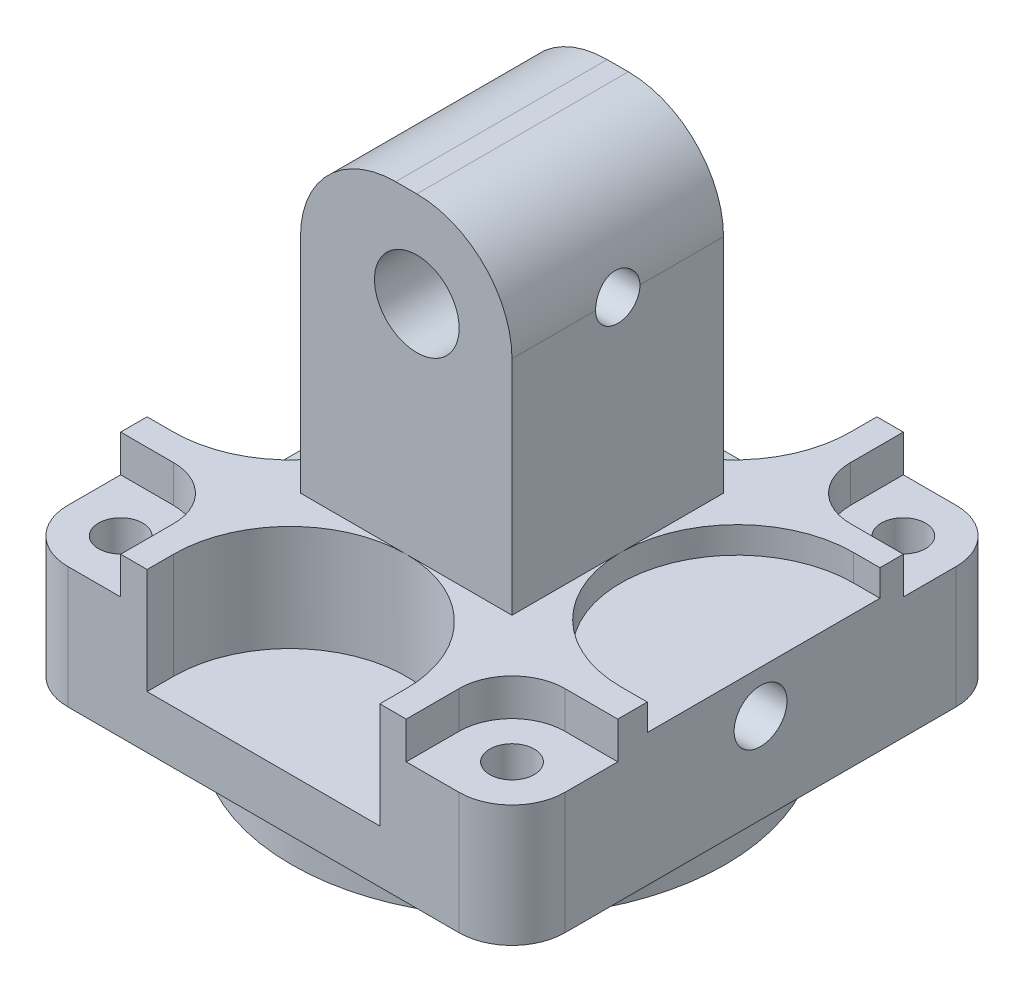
ISO-10303-21;
HEADER;
FILE_DESCRIPTION(('STEP AP214'),'2;1');
FILE_NAME('part.step','',(''),(''),'','','');
FILE_SCHEMA(('AUTOMOTIVE_DESIGN { 1 0 10303 214 1 1 1 1 }'));
ENDSEC;
DATA;
#1=APPLICATION_CONTEXT('core data for automotive mechanical design processes');
#2=APPLICATION_PROTOCOL_DEFINITION('international standard','automotive_design',2000,#1);
#3=PRODUCT_CONTEXT('',#1,'mechanical');
#4=PRODUCT('Part','Part','',(#3));
#5=PRODUCT_RELATED_PRODUCT_CATEGORY('part','',(#4));
#6=PRODUCT_DEFINITION_FORMATION('','',#4);
#7=PRODUCT_DEFINITION_CONTEXT('part definition',#1,'design');
#8=PRODUCT_DEFINITION('design','',#6,#7);
#9=PRODUCT_DEFINITION_SHAPE('','',#8);
#10=(LENGTH_UNIT() NAMED_UNIT(*) SI_UNIT(.MILLI.,.METRE.));
#11=(NAMED_UNIT(*) PLANE_ANGLE_UNIT() SI_UNIT($,.RADIAN.));
#12=(NAMED_UNIT(*) SI_UNIT($,.STERADIAN.) SOLID_ANGLE_UNIT());
#13=UNCERTAINTY_MEASURE_WITH_UNIT(LENGTH_MEASURE(1.E-05),#10,'distance_accuracy_value','');
#14=(GEOMETRIC_REPRESENTATION_CONTEXT(3) GLOBAL_UNCERTAINTY_ASSIGNED_CONTEXT((#13)) GLOBAL_UNIT_ASSIGNED_CONTEXT((#10,
#11,#12)) REPRESENTATION_CONTEXT('',''));
#15=CARTESIAN_POINT('',(0.,0.,0.));
#16=DIRECTION('',(0.,0.,1.));
#17=DIRECTION('',(1.,0.,0.));
#18=AXIS2_PLACEMENT_3D('',#15,#16,#17);
#19=CARTESIAN_POINT('',(-23.5,15.,47.));
#20=DIRECTION('',(0.,-1.,0.));
#21=DIRECTION('',(0.,0.,-1.));
#22=AXIS2_PLACEMENT_3D('',#19,#20,#21);
#23=PLANE('',#22);
#24=DIRECTION('',(0.,0.,-1.));
#25=VECTOR('',#24,1.);
#26=CARTESIAN_POINT('',(10.,15.,13.5));
#27=LINE('',#26,#25);
#28=CARTESIAN_POINT('',(10.,15.,33.5));
#29=VERTEX_POINT('',#28);
#30=CARTESIAN_POINT('',(10.,15.,23.4203007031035));
#31=VERTEX_POINT('',#30);
#32=EDGE_CURVE('E423',#29,#31,#27,.T.);
#33=ORIENTED_EDGE('',*,*,#32,.F.);
#34=DIRECTION('',(1.,0.,0.));
#35=VECTOR('',#34,1.);
#36=CARTESIAN_POINT('',(-10.,15.,33.5));
#37=LINE('',#36,#35);
#38=CARTESIAN_POINT('',(0.,15.,33.5));
#39=VERTEX_POINT('',#38);
#40=EDGE_CURVE('E412',#39,#29,#37,.T.);
#41=ORIENTED_EDGE('',*,*,#40,.F.);
#42=CARTESIAN_POINT('',(0.,15.,44.5));
#43=DIRECTION('',(0.,1.,0.));
#44=DIRECTION('',(0.,0.,1.));
#45=AXIS2_PLACEMENT_3D('',#42,#43,#44);
#46=CIRCLE('',#45,11.);
#47=CARTESIAN_POINT('',(11.,15.,44.5));
#48=VERTEX_POINT('',#47);
#49=EDGE_CURVE('E692',#48,#39,#46,.T.);
#50=ORIENTED_EDGE('',*,*,#49,.F.);
#51=DIRECTION('',(0.,0.,-1.));
#52=VECTOR('',#51,1.);
#53=CARTESIAN_POINT('',(11.,15.,44.5));
#54=LINE('',#53,#52);
#55=CARTESIAN_POINT('',(11.,15.,47.));
#56=VERTEX_POINT('',#55);
#57=EDGE_CURVE('E684',#56,#48,#54,.T.);
#58=ORIENTED_EDGE('',*,*,#57,.F.);
#59=DIRECTION('',(-1.,0.,0.));
#60=VECTOR('',#59,1.);
#61=CARTESIAN_POINT('',(-23.5,15.,47.));
#62=LINE('',#61,#60);
#63=CARTESIAN_POINT('',(13.5,15.,47.));
#64=VERTEX_POINT('',#63);
#65=EDGE_CURVE('E529',#64,#56,#62,.T.);
#66=ORIENTED_EDGE('',*,*,#65,.F.);
#67=DIRECTION('',(0.,0.,1.));
#68=VECTOR('',#67,1.);
#69=CARTESIAN_POINT('',(13.5,15.,42.));
#70=LINE('',#69,#68);
#71=CARTESIAN_POINT('',(13.5,15.,42.));
#72=VERTEX_POINT('',#71);
#73=EDGE_CURVE('E774',#72,#64,#70,.T.);
#74=ORIENTED_EDGE('',*,*,#73,.F.);
#75=CARTESIAN_POINT('',(18.5,15.,42.));
#76=DIRECTION('',(0.,1.,0.));
#77=DIRECTION('',(0.,0.,1.));
#78=AXIS2_PLACEMENT_3D('',#75,#76,#77);
#79=CIRCLE('',#78,5.);
#80=CARTESIAN_POINT('',(18.5,15.,37.));
#81=VERTEX_POINT('',#80);
#82=EDGE_CURVE('E771',#81,#72,#79,.T.);
#83=ORIENTED_EDGE('',*,*,#82,.F.);
#84=DIRECTION('',(-1.,0.,0.));
#85=VECTOR('',#84,1.);
#86=CARTESIAN_POINT('',(18.5,15.,37.));
#87=LINE('',#86,#85);
#88=CARTESIAN_POINT('',(23.5,15.,37.));
#89=VERTEX_POINT('',#88);
#90=EDGE_CURVE('E758',#89,#81,#87,.T.);
#91=ORIENTED_EDGE('',*,*,#90,.F.);
#92=DIRECTION('',(0.,0.,-1.));
#93=VECTOR('',#92,1.);
#94=CARTESIAN_POINT('',(23.5,15.,47.));
#95=LINE('',#94,#93);
#96=CARTESIAN_POINT('',(23.5,15.,34.2115152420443));
#97=VERTEX_POINT('',#96);
#98=EDGE_CURVE('E539',#89,#97,#95,.T.);
#99=ORIENTED_EDGE('',*,*,#98,.T.);
#100=DIRECTION('',(1.,0.,0.));
#101=VECTOR('',#100,1.);
#102=CARTESIAN_POINT('',(20.9980183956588,15.,34.2115152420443));
#103=LINE('',#102,#101);
#104=CARTESIAN_POINT('',(20.9980183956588,15.,34.2115152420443));
#105=VERTEX_POINT('',#104);
#106=EDGE_CURVE('E649',#105,#97,#103,.T.);
#107=ORIENTED_EDGE('',*,*,#106,.F.);
#108=CARTESIAN_POINT('',(20.9980183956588,15.,23.2115152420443));
#109=DIRECTION('',(0.,1.,0.));
#110=DIRECTION('',(0.,0.,1.));
#111=AXIS2_PLACEMENT_3D('',#108,#109,#110);
#112=CIRCLE('',#111,11.);
#113=EDGE_CURVE('E654',#31,#105,#112,.T.);
#114=ORIENTED_EDGE('',*,*,#113,.F.);
#115=EDGE_LOOP('',(#33,#41,#50,#58,#66,#74,#83,#91,#99,#107,#114));
#116=FACE_BOUND('',#115,.T.);
#117=ADVANCED_FACE('F40',(#116),#23,.F.);
#118=CARTESIAN_POINT('',(-10.,15.,33.5));
#119=VERTEX_POINT('',#118);
#120=EDGE_CURVE('E413',#119,#39,#37,.T.);
#121=ORIENTED_EDGE('',*,*,#120,.F.);
#122=DIRECTION('',(0.,0.,1.));
#123=VECTOR('',#122,1.);
#124=CARTESIAN_POINT('',(-10.,15.,13.5));
#125=LINE('',#124,#123);
#126=CARTESIAN_POINT('',(-10.,15.,23.5));
#127=VERTEX_POINT('',#126);
#128=EDGE_CURVE('E390',#127,#119,#125,.T.);
#129=ORIENTED_EDGE('',*,*,#128,.F.);
#130=CARTESIAN_POINT('',(-21.,15.,23.5));
#131=DIRECTION('',(0.,1.,0.));
#132=DIRECTION('',(0.,0.,1.));
#133=AXIS2_PLACEMENT_3D('',#130,#131,#132);
#134=CIRCLE('',#133,11.);
#135=CARTESIAN_POINT('',(-21.,15.,34.5));
#136=VERTEX_POINT('',#135);
#137=EDGE_CURVE('E457',#136,#127,#134,.T.);
#138=ORIENTED_EDGE('',*,*,#137,.F.);
#139=DIRECTION('',(1.,0.,0.));
#140=VECTOR('',#139,1.);
#141=CARTESIAN_POINT('',(-21.,15.,34.5));
#142=LINE('',#141,#140);
#143=CARTESIAN_POINT('',(-23.5,15.,34.5));
#144=VERTEX_POINT('',#143);
#145=EDGE_CURVE('E467',#144,#136,#142,.T.);
#146=ORIENTED_EDGE('',*,*,#145,.F.);
#147=DIRECTION('',(0.,0.,-1.));
#148=VECTOR('',#147,1.);
#149=CARTESIAN_POINT('',(-23.5,15.,47.));
#150=LINE('',#149,#148);
#151=CARTESIAN_POINT('',(-23.5,15.,37.));
#152=VERTEX_POINT('',#151);
#153=EDGE_CURVE('E536',#152,#144,#150,.T.);
#154=ORIENTED_EDGE('',*,*,#153,.F.);
#155=DIRECTION('',(-1.,0.,0.));
#156=VECTOR('',#155,1.);
#157=CARTESIAN_POINT('',(-18.5,15.,37.));
#158=LINE('',#157,#156);
#159=CARTESIAN_POINT('',(-18.5,15.,37.));
#160=VERTEX_POINT('',#159);
#161=EDGE_CURVE('E731',#160,#152,#158,.T.);
#162=ORIENTED_EDGE('',*,*,#161,.F.);
#163=CARTESIAN_POINT('',(-18.5,15.,42.));
#164=DIRECTION('',(0.,1.,0.));
#165=DIRECTION('',(0.,0.,1.));
#166=AXIS2_PLACEMENT_3D('',#163,#164,#165);
#167=CIRCLE('',#166,5.);
#168=CARTESIAN_POINT('',(-13.5,15.,42.));
#169=VERTEX_POINT('',#168);
#170=EDGE_CURVE('E734',#169,#160,#167,.T.);
#171=ORIENTED_EDGE('',*,*,#170,.F.);
#172=DIRECTION('',(0.,0.,-1.));
#173=VECTOR('',#172,1.);
#174=CARTESIAN_POINT('',(-13.5,15.,42.));
#175=LINE('',#174,#173);
#176=CARTESIAN_POINT('',(-13.5,15.,47.));
#177=VERTEX_POINT('',#176);
#178=EDGE_CURVE('E736',#177,#169,#175,.T.);
#179=ORIENTED_EDGE('',*,*,#178,.F.);
#180=CARTESIAN_POINT('',(-11.,15.,47.));
#181=VERTEX_POINT('',#180);
#182=EDGE_CURVE('E527',#181,#177,#62,.T.);
#183=ORIENTED_EDGE('',*,*,#182,.F.);
#184=DIRECTION('',(0.,0.,1.));
#185=VECTOR('',#184,1.);
#186=CARTESIAN_POINT('',(-11.,15.,47.));
#187=LINE('',#186,#185);
#188=CARTESIAN_POINT('',(-11.,15.,44.5));
#189=VERTEX_POINT('',#188);
#190=EDGE_CURVE('E695',#189,#181,#187,.T.);
#191=ORIENTED_EDGE('',*,*,#190,.F.);
#192=EDGE_CURVE('E671',#39,#189,#46,.T.);
#193=ORIENTED_EDGE('',*,*,#192,.F.);
#194=EDGE_LOOP('',(#121,#129,#138,#146,#154,#162,#171,#179,#183,#191,#193));
#195=FACE_BOUND('',#194,.T.);
#196=ADVANCED_FACE('F615',(#195),#23,.F.);
#197=CARTESIAN_POINT('',(-10.,15.,13.5));
#198=VERTEX_POINT('',#197);
#199=EDGE_CURVE('E394',#198,#127,#125,.T.);
#200=ORIENTED_EDGE('',*,*,#199,.F.);
#201=DIRECTION('',(-1.,0.,0.));
#202=VECTOR('',#201,1.);
#203=CARTESIAN_POINT('',(-10.,15.,13.5));
#204=LINE('',#203,#202);
#205=CARTESIAN_POINT('',(0.,15.,13.5));
#206=VERTEX_POINT('',#205);
#207=EDGE_CURVE('E425',#206,#198,#204,.T.);
#208=ORIENTED_EDGE('',*,*,#207,.F.);
#209=CARTESIAN_POINT('',(0.,15.,2.5));
#210=DIRECTION('',(0.,1.,0.));
#211=DIRECTION('',(0.,0.,1.));
#212=AXIS2_PLACEMENT_3D('',#209,#210,#211);
#213=CIRCLE('',#212,11.);
#214=CARTESIAN_POINT('',(-11.,15.,2.49999999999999));
#215=VERTEX_POINT('',#214);
#216=EDGE_CURVE('E497',#215,#206,#213,.T.);
#217=ORIENTED_EDGE('',*,*,#216,.F.);
#218=DIRECTION('',(0.,0.,1.));
#219=VECTOR('',#218,1.);
#220=CARTESIAN_POINT('',(-11.,15.,2.49999999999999));
#221=LINE('',#220,#219);
#222=CARTESIAN_POINT('',(-11.,15.,0.));
#223=VERTEX_POINT('',#222);
#224=EDGE_CURVE('E489',#223,#215,#221,.T.);
#225=ORIENTED_EDGE('',*,*,#224,.F.);
#226=DIRECTION('',(-1.,0.,0.));
#227=VECTOR('',#226,1.);
#228=CARTESIAN_POINT('',(-23.5,15.,0.));
#229=LINE('',#228,#227);
#230=CARTESIAN_POINT('',(-13.5,15.,0.));
#231=VERTEX_POINT('',#230);
#232=EDGE_CURVE('E534',#223,#231,#229,.T.);
#233=ORIENTED_EDGE('',*,*,#232,.T.);
#234=DIRECTION('',(0.,0.,-1.));
#235=VECTOR('',#234,1.);
#236=CARTESIAN_POINT('',(-13.5,15.,5.));
#237=LINE('',#236,#235);
#238=CARTESIAN_POINT('',(-13.5,15.,5.));
#239=VERTEX_POINT('',#238);
#240=EDGE_CURVE('E1031',#239,#231,#237,.T.);
#241=ORIENTED_EDGE('',*,*,#240,.F.);
#242=CARTESIAN_POINT('',(-18.5,15.,5.));
#243=DIRECTION('',(0.,1.,0.));
#244=DIRECTION('',(0.,0.,1.));
#245=AXIS2_PLACEMENT_3D('',#242,#243,#244);
#246=CIRCLE('',#245,5.);
#247=CARTESIAN_POINT('',(-18.5,15.,10.));
#248=VERTEX_POINT('',#247);
#249=EDGE_CURVE('E428',#248,#239,#246,.T.);
#250=ORIENTED_EDGE('',*,*,#249,.F.);
#251=DIRECTION('',(1.,0.,0.));
#252=VECTOR('',#251,1.);
#253=CARTESIAN_POINT('',(-18.5,15.,10.));
#254=LINE('',#253,#252);
#255=CARTESIAN_POINT('',(-23.5,15.,10.));
#256=VERTEX_POINT('',#255);
#257=EDGE_CURVE('E1033',#256,#248,#254,.T.);
#258=ORIENTED_EDGE('',*,*,#257,.F.);
#259=CARTESIAN_POINT('',(-23.5,15.,12.5));
#260=VERTEX_POINT('',#259);
#261=EDGE_CURVE('E531',#260,#256,#150,.T.);
#262=ORIENTED_EDGE('',*,*,#261,.F.);
#263=DIRECTION('',(-1.,0.,0.));
#264=VECTOR('',#263,1.);
#265=CARTESIAN_POINT('',(-21.,15.,12.5));
#266=LINE('',#265,#264);
#267=CARTESIAN_POINT('',(-21.,15.,12.5));
#268=VERTEX_POINT('',#267);
#269=EDGE_CURVE('E454',#268,#260,#266,.T.);
#270=ORIENTED_EDGE('',*,*,#269,.F.);
#271=EDGE_CURVE('E451',#127,#268,#134,.T.);
#272=ORIENTED_EDGE('',*,*,#271,.F.);
#273=EDGE_LOOP('',(#200,#208,#217,#225,#233,#241,#250,#258,#262,#270,#272));
#274=FACE_BOUND('',#273,.T.);
#275=ADVANCED_FACE('F449',(#274),#23,.F.);
#276=CARTESIAN_POINT('',(10.,15.,23.0027297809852));
#277=VERTEX_POINT('',#276);
#278=CARTESIAN_POINT('',(10.,15.,13.5));
#279=VERTEX_POINT('',#278);
#280=EDGE_CURVE('E415',#277,#279,#27,.T.);
#281=ORIENTED_EDGE('',*,*,#280,.F.);
#282=CARTESIAN_POINT('',(20.9980183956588,15.,12.2115152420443));
#283=VERTEX_POINT('',#282);
#284=EDGE_CURVE('E640',#283,#277,#112,.T.);
#285=ORIENTED_EDGE('',*,*,#284,.F.);
#286=DIRECTION('',(-1.,0.,0.));
#287=VECTOR('',#286,1.);
#288=CARTESIAN_POINT('',(20.9980183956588,15.,12.2115152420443));
#289=LINE('',#288,#287);
#290=CARTESIAN_POINT('',(23.5,15.,12.2115152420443));
#291=VERTEX_POINT('',#290);
#292=EDGE_CURVE('E652',#291,#283,#289,.T.);
#293=ORIENTED_EDGE('',*,*,#292,.F.);
#294=CARTESIAN_POINT('',(23.5,15.,10.));
#295=VERTEX_POINT('',#294);
#296=EDGE_CURVE('E538',#291,#295,#95,.T.);
#297=ORIENTED_EDGE('',*,*,#296,.T.);
#298=DIRECTION('',(1.,0.,0.));
#299=VECTOR('',#298,1.);
#300=CARTESIAN_POINT('',(18.5,15.,10.));
#301=LINE('',#300,#299);
#302=CARTESIAN_POINT('',(18.5,15.,10.));
#303=VERTEX_POINT('',#302);
#304=EDGE_CURVE('E831',#303,#295,#301,.T.);
#305=ORIENTED_EDGE('',*,*,#304,.F.);
#306=CARTESIAN_POINT('',(18.5,15.,5.));
#307=DIRECTION('',(0.,1.,0.));
#308=DIRECTION('',(0.,0.,1.));
#309=AXIS2_PLACEMENT_3D('',#306,#307,#308);
#310=CIRCLE('',#309,5.);
#311=CARTESIAN_POINT('',(13.5,15.,5.));
#312=VERTEX_POINT('',#311);
#313=EDGE_CURVE('E834',#312,#303,#310,.T.);
#314=ORIENTED_EDGE('',*,*,#313,.F.);
#315=DIRECTION('',(0.,0.,1.));
#316=VECTOR('',#315,1.);
#317=CARTESIAN_POINT('',(13.5,15.,5.));
#318=LINE('',#317,#316);
#319=CARTESIAN_POINT('',(13.5,15.,0.));
#320=VERTEX_POINT('',#319);
#321=EDGE_CURVE('E836',#320,#312,#318,.T.);
#322=ORIENTED_EDGE('',*,*,#321,.F.);
#323=CARTESIAN_POINT('',(11.,15.,0.));
#324=VERTEX_POINT('',#323);
#325=EDGE_CURVE('E528',#320,#324,#229,.T.);
#326=ORIENTED_EDGE('',*,*,#325,.T.);
#327=DIRECTION('',(0.,0.,-1.));
#328=VECTOR('',#327,1.);
#329=CARTESIAN_POINT('',(11.,15.,2.49999999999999));
#330=LINE('',#329,#328);
#331=CARTESIAN_POINT('',(11.,15.,2.49999999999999));
#332=VERTEX_POINT('',#331);
#333=EDGE_CURVE('E500',#332,#324,#330,.T.);
#334=ORIENTED_EDGE('',*,*,#333,.F.);
#335=EDGE_CURVE('E476',#206,#332,#213,.T.);
#336=ORIENTED_EDGE('',*,*,#335,.F.);
#337=EDGE_CURVE('E408',#279,#206,#204,.T.);
#338=ORIENTED_EDGE('',*,*,#337,.F.);
#339=EDGE_LOOP('',(#281,#285,#293,#297,#305,#314,#322,#326,#334,#336,#338));
#340=FACE_BOUND('',#339,.T.);
#341=ADVANCED_FACE('F618',(#340),#23,.F.);
#342=CARTESIAN_POINT('',(-18.5,15.,5.));
#343=DIRECTION('',(0.,-1.,0.));
#344=DIRECTION('',(0.,0.,-1.));
#345=AXIS2_PLACEMENT_3D('',#342,#343,#344);
#346=CYLINDRICAL_SURFACE('',#345,5.);
#347=DIRECTION('',(0.,-1.,0.));
#348=VECTOR('',#347,1.);
#349=CARTESIAN_POINT('',(-23.5,15.,5.));
#350=LINE('',#349,#348);
#351=CARTESIAN_POINT('',(-23.5,11.5,5.));
#352=VERTEX_POINT('',#351);
#353=CARTESIAN_POINT('',(-23.5,0.,5.));
#354=VERTEX_POINT('',#353);
#355=EDGE_CURVE('E563',#352,#354,#350,.T.);
#356=ORIENTED_EDGE('',*,*,#355,.F.);
#357=CARTESIAN_POINT('',(-18.5,11.5,5.));
#358=DIRECTION('',(0.,1.,0.));
#359=DIRECTION('',(0.,0.,1.));
#360=AXIS2_PLACEMENT_3D('',#357,#358,#359);
#361=CIRCLE('',#360,5.);
#362=CARTESIAN_POINT('',(-18.5,11.5,0.));
#363=VERTEX_POINT('',#362);
#364=EDGE_CURVE('E1015',#363,#352,#361,.T.);
#365=ORIENTED_EDGE('',*,*,#364,.F.);
#366=DIRECTION('',(0.,-1.,0.));
#367=VECTOR('',#366,1.);
#368=CARTESIAN_POINT('',(-18.5,0.,0.));
#369=LINE('',#368,#367);
#370=CARTESIAN_POINT('',(-18.5,0.,0.));
#371=VERTEX_POINT('',#370);
#372=EDGE_CURVE('E573',#371,#363,#369,.F.);
#373=ORIENTED_EDGE('',*,*,#372,.F.);
#374=CARTESIAN_POINT('',(-18.5,0.,5.));
#375=DIRECTION('',(0.,1.,0.));
#376=DIRECTION('',(0.,0.,1.));
#377=AXIS2_PLACEMENT_3D('',#374,#375,#376);
#378=CIRCLE('',#377,5.);
#379=EDGE_CURVE('E555',#354,#371,#378,.F.);
#380=ORIENTED_EDGE('',*,*,#379,.F.);
#381=EDGE_LOOP('',(#356,#365,#373,#380));
#382=FACE_BOUND('',#381,.T.);
#383=ADVANCED_FACE('F626',(#382),#346,.T.);
#384=CARTESIAN_POINT('',(-18.5,-8.5,5.));
#385=DIRECTION('',(0.,1.,0.));
#386=DIRECTION('',(0.,0.,1.));
#387=AXIS2_PLACEMENT_3D('',#384,#385,#386);
#388=CYLINDRICAL_SURFACE('',#387,2.1);
#389=CARTESIAN_POINT('',(-18.5,0.,5.));
#390=DIRECTION('',(0.,1.,0.));
#391=DIRECTION('',(0.,0.,1.));
#392=AXIS2_PLACEMENT_3D('',#389,#390,#391);
#393=CIRCLE('',#392,2.1);
#394=CARTESIAN_POINT('',(-18.5,0.,7.09999999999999));
#395=VERTEX_POINT('',#394);
#396=EDGE_CURVE('E797',#395,#395,#393,.T.);
#397=ORIENTED_EDGE('',*,*,#396,.F.);
#398=EDGE_LOOP('',(#397));
#399=FACE_BOUND('',#398,.T.);
#400=CARTESIAN_POINT('',(-18.5,11.5,5.));
#401=DIRECTION('',(0.,1.,0.));
#402=DIRECTION('',(0.,0.,1.));
#403=AXIS2_PLACEMENT_3D('',#400,#401,#402);
#404=CIRCLE('',#403,2.1);
#405=CARTESIAN_POINT('',(-18.5,11.5,7.09999999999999));
#406=VERTEX_POINT('',#405);
#407=EDGE_CURVE('E841',#406,#406,#404,.F.);
#408=ORIENTED_EDGE('',*,*,#407,.F.);
#409=EDGE_LOOP('',(#408));
#410=FACE_BOUND('',#409,.T.);
#411=ADVANCED_FACE('F632',(#399,#410),#388,.F.);
#412=CARTESIAN_POINT('',(18.5,15.,5.));
#413=DIRECTION('',(0.,1.,0.));
#414=DIRECTION('',(-1.,0.,0.));
#415=AXIS2_PLACEMENT_3D('',#412,#413,#414);
#416=CYLINDRICAL_SURFACE('',#415,5.);
#417=DIRECTION('',(0.,1.,0.));
#418=VECTOR('',#417,1.);
#419=CARTESIAN_POINT('',(18.5,0.,0.));
#420=LINE('',#419,#418);
#421=CARTESIAN_POINT('',(18.5,11.5,0.));
#422=VERTEX_POINT('',#421);
#423=CARTESIAN_POINT('',(18.5,0.,0.));
#424=VERTEX_POINT('',#423);
#425=EDGE_CURVE('E576',#422,#424,#420,.F.);
#426=ORIENTED_EDGE('',*,*,#425,.F.);
#427=CARTESIAN_POINT('',(18.5,11.5,5.));
#428=DIRECTION('',(0.,1.,0.));
#429=DIRECTION('',(0.,0.,1.));
#430=AXIS2_PLACEMENT_3D('',#427,#428,#429);
#431=CIRCLE('',#430,5.);
#432=CARTESIAN_POINT('',(23.5,11.5,5.));
#433=VERTEX_POINT('',#432);
#434=EDGE_CURVE('E1049',#433,#422,#431,.T.);
#435=ORIENTED_EDGE('',*,*,#434,.F.);
#436=DIRECTION('',(0.,1.,0.));
#437=VECTOR('',#436,1.);
#438=CARTESIAN_POINT('',(23.5,15.,5.));
#439=LINE('',#438,#437);
#440=CARTESIAN_POINT('',(23.5,0.,5.));
#441=VERTEX_POINT('',#440);
#442=EDGE_CURVE('E568',#441,#433,#439,.T.);
#443=ORIENTED_EDGE('',*,*,#442,.F.);
#444=CARTESIAN_POINT('',(18.5,0.,5.));
#445=DIRECTION('',(0.,1.,0.));
#446=DIRECTION('',(0.,0.,1.));
#447=AXIS2_PLACEMENT_3D('',#444,#445,#446);
#448=CIRCLE('',#447,5.);
#449=EDGE_CURVE('E557',#424,#441,#448,.F.);
#450=ORIENTED_EDGE('',*,*,#449,.F.);
#451=EDGE_LOOP('',(#426,#435,#443,#450));
#452=FACE_BOUND('',#451,.T.);
#453=ADVANCED_FACE('F920',(#452),#416,.T.);
#454=CARTESIAN_POINT('',(18.5,-8.5,5.));
#455=DIRECTION('',(0.,1.,0.));
#456=DIRECTION('',(0.,0.,1.));
#457=AXIS2_PLACEMENT_3D('',#454,#455,#456);
#458=CYLINDRICAL_SURFACE('',#457,2.1);
#459=CARTESIAN_POINT('',(18.5,0.,5.));
#460=DIRECTION('',(0.,1.,0.));
#461=DIRECTION('',(0.,0.,1.));
#462=AXIS2_PLACEMENT_3D('',#459,#460,#461);
#463=CIRCLE('',#462,2.1);
#464=CARTESIAN_POINT('',(18.5,0.,7.09999999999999));
#465=VERTEX_POINT('',#464);
#466=EDGE_CURVE('E806',#465,#465,#463,.T.);
#467=ORIENTED_EDGE('',*,*,#466,.F.);
#468=EDGE_LOOP('',(#467));
#469=FACE_BOUND('',#468,.T.);
#470=CARTESIAN_POINT('',(18.5,11.5,5.));
#471=DIRECTION('',(0.,1.,0.));
#472=DIRECTION('',(0.,0.,1.));
#473=AXIS2_PLACEMENT_3D('',#470,#471,#472);
#474=CIRCLE('',#473,2.1);
#475=CARTESIAN_POINT('',(18.5,11.5,7.09999999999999));
#476=VERTEX_POINT('',#475);
#477=EDGE_CURVE('E741',#476,#476,#474,.F.);
#478=ORIENTED_EDGE('',*,*,#477,.F.);
#479=EDGE_LOOP('',(#478));
#480=FACE_BOUND('',#479,.T.);
#481=ADVANCED_FACE('F933',(#469,#480),#458,.F.);
#482=CARTESIAN_POINT('',(-18.5,0.,42.));
#483=DIRECTION('',(0.,1.,0.));
#484=DIRECTION('',(0.,0.,1.));
#485=AXIS2_PLACEMENT_3D('',#482,#483,#484);
#486=CYLINDRICAL_SURFACE('',#485,5.);
#487=DIRECTION('',(0.,-1.,0.));
#488=VECTOR('',#487,1.);
#489=CARTESIAN_POINT('',(-18.5,0.,47.));
#490=LINE('',#489,#488);
#491=CARTESIAN_POINT('',(-18.5,11.5,47.));
#492=VERTEX_POINT('',#491);
#493=CARTESIAN_POINT('',(-18.5,0.,47.));
#494=VERTEX_POINT('',#493);
#495=EDGE_CURVE('E553',#492,#494,#490,.T.);
#496=ORIENTED_EDGE('',*,*,#495,.F.);
#497=CARTESIAN_POINT('',(-18.5,11.5,42.));
#498=DIRECTION('',(0.,1.,0.));
#499=DIRECTION('',(0.,0.,1.));
#500=AXIS2_PLACEMENT_3D('',#497,#498,#499);
#501=CIRCLE('',#500,5.);
#502=CARTESIAN_POINT('',(-23.5,11.5,42.));
#503=VERTEX_POINT('',#502);
#504=EDGE_CURVE('E860',#503,#492,#501,.T.);
#505=ORIENTED_EDGE('',*,*,#504,.F.);
#506=DIRECTION('',(0.,-1.,0.));
#507=VECTOR('',#506,1.);
#508=CARTESIAN_POINT('',(-23.5,15.,42.));
#509=LINE('',#508,#507);
#510=CARTESIAN_POINT('',(-23.5,0.,42.));
#511=VERTEX_POINT('',#510);
#512=EDGE_CURVE('E565',#511,#503,#509,.F.);
#513=ORIENTED_EDGE('',*,*,#512,.F.);
#514=CARTESIAN_POINT('',(-18.5,0.,42.));
#515=DIRECTION('',(0.,1.,0.));
#516=DIRECTION('',(0.,0.,1.));
#517=AXIS2_PLACEMENT_3D('',#514,#515,#516);
#518=CIRCLE('',#517,5.);
#519=EDGE_CURVE('E561',#494,#511,#518,.F.);
#520=ORIENTED_EDGE('',*,*,#519,.F.);
#521=EDGE_LOOP('',(#496,#505,#513,#520));
#522=FACE_BOUND('',#521,.T.);
#523=ADVANCED_FACE('F926',(#522),#486,.T.);
#524=CARTESIAN_POINT('',(-18.5,-8.5,42.));
#525=DIRECTION('',(0.,1.,0.));
#526=DIRECTION('',(0.,0.,1.));
#527=AXIS2_PLACEMENT_3D('',#524,#525,#526);
#528=CYLINDRICAL_SURFACE('',#527,2.09999999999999);
#529=CARTESIAN_POINT('',(-18.5,0.,42.));
#530=DIRECTION('',(0.,1.,0.));
#531=DIRECTION('',(0.,0.,1.));
#532=AXIS2_PLACEMENT_3D('',#529,#530,#531);
#533=CIRCLE('',#532,2.09999999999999);
#534=CARTESIAN_POINT('',(-18.5,0.,44.1));
#535=VERTEX_POINT('',#534);
#536=EDGE_CURVE('E800',#535,#535,#533,.T.);
#537=ORIENTED_EDGE('',*,*,#536,.F.);
#538=EDGE_LOOP('',(#537));
#539=FACE_BOUND('',#538,.T.);
#540=CARTESIAN_POINT('',(-18.5,11.5,42.));
#541=DIRECTION('',(0.,1.,0.));
#542=DIRECTION('',(0.,0.,1.));
#543=AXIS2_PLACEMENT_3D('',#540,#541,#542);
#544=CIRCLE('',#543,2.09999999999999);
#545=CARTESIAN_POINT('',(-18.5,11.5,44.1));
#546=VERTEX_POINT('',#545);
#547=EDGE_CURVE('E747',#546,#546,#544,.F.);
#548=ORIENTED_EDGE('',*,*,#547,.F.);
#549=EDGE_LOOP('',(#548));
#550=FACE_BOUND('',#549,.T.);
#551=ADVANCED_FACE('F922',(#539,#550),#528,.F.);
#552=CARTESIAN_POINT('',(18.5,0.,42.));
#553=DIRECTION('',(0.,-1.,0.));
#554=DIRECTION('',(1.,0.,0.));
#555=AXIS2_PLACEMENT_3D('',#552,#553,#554);
#556=CYLINDRICAL_SURFACE('',#555,5.);
#557=DIRECTION('',(0.,1.,0.));
#558=VECTOR('',#557,1.);
#559=CARTESIAN_POINT('',(23.5,0.,42.));
#560=LINE('',#559,#558);
#561=CARTESIAN_POINT('',(23.5,11.5,42.));
#562=VERTEX_POINT('',#561);
#563=CARTESIAN_POINT('',(23.5,0.,42.));
#564=VERTEX_POINT('',#563);
#565=EDGE_CURVE('E571',#562,#564,#560,.F.);
#566=ORIENTED_EDGE('',*,*,#565,.F.);
#567=CARTESIAN_POINT('',(18.5,11.5,42.));
#568=DIRECTION('',(0.,1.,0.));
#569=DIRECTION('',(0.,0.,1.));
#570=AXIS2_PLACEMENT_3D('',#567,#568,#569);
#571=CIRCLE('',#570,5.);
#572=CARTESIAN_POINT('',(18.5,11.5,47.));
#573=VERTEX_POINT('',#572);
#574=EDGE_CURVE('E763',#573,#562,#571,.T.);
#575=ORIENTED_EDGE('',*,*,#574,.F.);
#576=DIRECTION('',(0.,1.,0.));
#577=VECTOR('',#576,1.);
#578=CARTESIAN_POINT('',(18.5,15.,47.));
#579=LINE('',#578,#577);
#580=CARTESIAN_POINT('',(18.5,0.,47.));
#581=VERTEX_POINT('',#580);
#582=EDGE_CURVE('E550',#581,#573,#579,.T.);
#583=ORIENTED_EDGE('',*,*,#582,.F.);
#584=CARTESIAN_POINT('',(18.5,0.,42.));
#585=DIRECTION('',(0.,1.,0.));
#586=DIRECTION('',(0.,0.,1.));
#587=AXIS2_PLACEMENT_3D('',#584,#585,#586);
#588=CIRCLE('',#587,5.);
#589=EDGE_CURVE('E559',#564,#581,#588,.F.);
#590=ORIENTED_EDGE('',*,*,#589,.F.);
#591=EDGE_LOOP('',(#566,#575,#583,#590));
#592=FACE_BOUND('',#591,.T.);
#593=ADVANCED_FACE('F925',(#592),#556,.T.);
#594=CARTESIAN_POINT('',(18.5,-8.5,42.));
#595=DIRECTION('',(0.,1.,0.));
#596=DIRECTION('',(0.,0.,1.));
#597=AXIS2_PLACEMENT_3D('',#594,#595,#596);
#598=CYLINDRICAL_SURFACE('',#597,2.09999999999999);
#599=CARTESIAN_POINT('',(18.5,0.,42.));
#600=DIRECTION('',(0.,1.,0.));
#601=DIRECTION('',(0.,0.,1.));
#602=AXIS2_PLACEMENT_3D('',#599,#600,#601);
#603=CIRCLE('',#602,2.09999999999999);
#604=CARTESIAN_POINT('',(18.5,0.,44.1));
#605=VERTEX_POINT('',#604);
#606=EDGE_CURVE('E803',#605,#605,#603,.T.);
#607=ORIENTED_EDGE('',*,*,#606,.F.);
#608=EDGE_LOOP('',(#607));
#609=FACE_BOUND('',#608,.T.);
#610=CARTESIAN_POINT('',(18.5,11.5,42.));
#611=DIRECTION('',(0.,1.,0.));
#612=DIRECTION('',(0.,0.,1.));
#613=AXIS2_PLACEMENT_3D('',#610,#611,#612);
#614=CIRCLE('',#613,2.09999999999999);
#615=CARTESIAN_POINT('',(18.5,11.5,44.1));
#616=VERTEX_POINT('',#615);
#617=EDGE_CURVE('E780',#616,#616,#614,.F.);
#618=ORIENTED_EDGE('',*,*,#617,.F.);
#619=EDGE_LOOP('',(#618));
#620=FACE_BOUND('',#619,.T.);
#621=ADVANCED_FACE('F928',(#609,#620),#598,.F.);
#622=CARTESIAN_POINT('',(0.,-5.,23.8472881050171));
#623=DIRECTION('',(0.,-1.,0.));
#624=DIRECTION('',(1.,0.,0.));
#625=AXIS2_PLACEMENT_3D('',#622,#623,#624);
#626=PLANE('',#625);
#627=CARTESIAN_POINT('',(0.,-5.,23.8472881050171));
#628=DIRECTION('',(0.,-1.,0.));
#629=DIRECTION('',(1.,0.,0.));
#630=AXIS2_PLACEMENT_3D('',#627,#628,#629);
#631=CIRCLE('',#630,20.5);
#632=CARTESIAN_POINT('',(20.5,-5.,23.8472881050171));
#633=VERTEX_POINT('',#632);
#634=EDGE_CURVE('E518',#633,#633,#631,.T.);
#635=ORIENTED_EDGE('',*,*,#634,.T.);
#636=EDGE_LOOP('',(#635));
#637=FACE_BOUND('',#636,.T.);
#638=CARTESIAN_POINT('',(0.,-5.,23.8472881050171));
#639=DIRECTION('',(0.,-1.,0.));
#640=DIRECTION('',(1.,0.,0.));
#641=AXIS2_PLACEMENT_3D('',#638,#639,#640);
#642=CIRCLE('',#641,9.75);
#643=CARTESIAN_POINT('',(9.75,-5.,23.8472881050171));
#644=VERTEX_POINT('',#643);
#645=EDGE_CURVE('E507',#644,#644,#642,.T.);
#646=ORIENTED_EDGE('',*,*,#645,.F.);
#647=EDGE_LOOP('',(#646));
#648=FACE_BOUND('',#647,.T.);
#649=ADVANCED_FACE('F931',(#637,#648),#626,.T.);
#650=CARTESIAN_POINT('',(-23.5,0.,47.));
#651=DIRECTION('',(0.,1.,0.));
#652=DIRECTION('',(0.,0.,1.));
#653=AXIS2_PLACEMENT_3D('',#650,#651,#652);
#654=PLANE('',#653);
#655=ORIENTED_EDGE('',*,*,#396,.T.);
#656=EDGE_LOOP('',(#655));
#657=FACE_BOUND('',#656,.T.);
#658=ORIENTED_EDGE('',*,*,#536,.T.);
#659=EDGE_LOOP('',(#658));
#660=FACE_BOUND('',#659,.T.);
#661=ORIENTED_EDGE('',*,*,#606,.T.);
#662=EDGE_LOOP('',(#661));
#663=FACE_BOUND('',#662,.T.);
#664=ORIENTED_EDGE('',*,*,#466,.T.);
#665=EDGE_LOOP('',(#664));
#666=FACE_BOUND('',#665,.T.);
#667=DIRECTION('',(1.,0.,0.));
#668=VECTOR('',#667,1.);
#669=CARTESIAN_POINT('',(-23.5,0.,47.));
#670=LINE('',#669,#668);
#671=EDGE_CURVE('E524',#494,#581,#670,.T.);
#672=ORIENTED_EDGE('',*,*,#671,.F.);
#673=ORIENTED_EDGE('',*,*,#519,.T.);
#674=DIRECTION('',(0.,0.,-1.));
#675=VECTOR('',#674,1.);
#676=CARTESIAN_POINT('',(-23.5,0.,47.));
#677=LINE('',#676,#675);
#678=EDGE_CURVE('E544',#511,#354,#677,.T.);
#679=ORIENTED_EDGE('',*,*,#678,.T.);
#680=ORIENTED_EDGE('',*,*,#379,.T.);
#681=DIRECTION('',(1.,0.,0.));
#682=VECTOR('',#681,1.);
#683=CARTESIAN_POINT('',(-23.5,0.,0.));
#684=LINE('',#683,#682);
#685=EDGE_CURVE('E523',#371,#424,#684,.T.);
#686=ORIENTED_EDGE('',*,*,#685,.T.);
#687=ORIENTED_EDGE('',*,*,#449,.T.);
#688=DIRECTION('',(0.,0.,-1.));
#689=VECTOR('',#688,1.);
#690=CARTESIAN_POINT('',(23.5,0.,47.));
#691=LINE('',#690,#689);
#692=EDGE_CURVE('E541',#564,#441,#691,.T.);
#693=ORIENTED_EDGE('',*,*,#692,.F.);
#694=ORIENTED_EDGE('',*,*,#589,.T.);
#695=EDGE_LOOP('',(#672,#673,#679,#680,#686,#687,#693,#694));
#696=FACE_BOUND('',#695,.T.);
#697=CARTESIAN_POINT('',(0.,0.,23.8472881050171));
#698=DIRECTION('',(0.,1.,0.));
#699=DIRECTION('',(0.,0.,1.));
#700=AXIS2_PLACEMENT_3D('',#697,#698,#699);
#701=CIRCLE('',#700,20.5);
#702=CARTESIAN_POINT('',(0.,0.,44.3472881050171));
#703=VERTEX_POINT('',#702);
#704=EDGE_CURVE('E547',#703,#703,#701,.F.);
#705=ORIENTED_EDGE('',*,*,#704,.F.);
#706=EDGE_LOOP('',(#705));
#707=FACE_BOUND('',#706,.T.);
#708=ADVANCED_FACE('F993',(#657,#660,#663,#666,#696,#707),#654,.F.);
#709=CARTESIAN_POINT('',(-23.5,15.,47.));
#710=DIRECTION('',(1.,0.,0.));
#711=DIRECTION('',(0.,0.,-1.));
#712=AXIS2_PLACEMENT_3D('',#709,#710,#711);
#713=PLANE('',#712);
#714=ORIENTED_EDGE('',*,*,#261,.T.);
#715=DIRECTION('',(0.,1.,0.));
#716=VECTOR('',#715,1.);
#717=CARTESIAN_POINT('',(-23.5,11.5,10.));
#718=LINE('',#717,#716);
#719=CARTESIAN_POINT('',(-23.5,11.5,10.));
#720=VERTEX_POINT('',#719);
#721=EDGE_CURVE('E1038',#720,#256,#718,.T.);
#722=ORIENTED_EDGE('',*,*,#721,.F.);
#723=DIRECTION('',(0.,0.,1.));
#724=VECTOR('',#723,1.);
#725=CARTESIAN_POINT('',(-23.5,11.5,10.));
#726=LINE('',#725,#724);
#727=EDGE_CURVE('E1018',#352,#720,#726,.T.);
#728=ORIENTED_EDGE('',*,*,#727,.F.);
#729=ORIENTED_EDGE('',*,*,#355,.T.);
#730=ORIENTED_EDGE('',*,*,#678,.F.);
#731=ORIENTED_EDGE('',*,*,#512,.T.);
#732=DIRECTION('',(0.,0.,1.));
#733=VECTOR('',#732,1.);
#734=CARTESIAN_POINT('',(-23.5,11.5,37.));
#735=LINE('',#734,#733);
#736=CARTESIAN_POINT('',(-23.5,11.5,37.));
#737=VERTEX_POINT('',#736);
#738=EDGE_CURVE('E858',#737,#503,#735,.T.);
#739=ORIENTED_EDGE('',*,*,#738,.F.);
#740=DIRECTION('',(0.,1.,0.));
#741=VECTOR('',#740,1.);
#742=CARTESIAN_POINT('',(-23.5,11.5,37.));
#743=LINE('',#742,#741);
#744=EDGE_CURVE('E727',#737,#152,#743,.T.);
#745=ORIENTED_EDGE('',*,*,#744,.T.);
#746=ORIENTED_EDGE('',*,*,#153,.T.);
#747=DIRECTION('',(0.,1.,0.));
#748=VECTOR('',#747,1.);
#749=CARTESIAN_POINT('',(-23.5,4.99999999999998,34.5));
#750=LINE('',#749,#748);
#751=CARTESIAN_POINT('',(-23.5,4.99999999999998,34.5));
#752=VERTEX_POINT('',#751);
#753=EDGE_CURVE('E477',#752,#144,#750,.T.);
#754=ORIENTED_EDGE('',*,*,#753,.F.);
#755=DIRECTION('',(0.,0.,1.));
#756=VECTOR('',#755,1.);
#757=CARTESIAN_POINT('',(-23.5,4.99999999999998,12.5));
#758=LINE('',#757,#756);
#759=CARTESIAN_POINT('',(-23.5,4.99999999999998,12.5));
#760=VERTEX_POINT('',#759);
#761=EDGE_CURVE('E712',#760,#752,#758,.T.);
#762=ORIENTED_EDGE('',*,*,#761,.F.);
#763=DIRECTION('',(0.,1.,0.));
#764=VECTOR('',#763,1.);
#765=CARTESIAN_POINT('',(-23.5,4.99999999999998,12.5));
#766=LINE('',#765,#764);
#767=EDGE_CURVE('E480',#760,#260,#766,.T.);
#768=ORIENTED_EDGE('',*,*,#767,.T.);
#769=EDGE_LOOP('',(#714,#722,#728,#729,#730,#731,#739,#745,#746,#754,#762,#768));
#770=FACE_BOUND('',#769,.T.);
#771=ADVANCED_FACE('F723',(#770),#713,.F.);
#772=CARTESIAN_POINT('',(23.5,15.,47.));
#773=DIRECTION('',(-1.,0.,0.));
#774=DIRECTION('',(0.,-1.,0.));
#775=AXIS2_PLACEMENT_3D('',#772,#773,#774);
#776=PLANE('',#775);
#777=CARTESIAN_POINT('',(23.5,8.5,23.5));
#778=DIRECTION('',(1.,0.,0.));
#779=DIRECTION('',(0.,0.,-1.));
#780=AXIS2_PLACEMENT_3D('',#777,#778,#779);
#781=CIRCLE('',#780,2.49999999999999);
#782=CARTESIAN_POINT('',(23.5,8.5,21.));
#783=VERTEX_POINT('',#782);
#784=EDGE_CURVE('E789',#783,#783,#781,.T.);
#785=ORIENTED_EDGE('',*,*,#784,.F.);
#786=EDGE_LOOP('',(#785));
#787=FACE_BOUND('',#786,.T.);
#788=DIRECTION('',(0.,0.,-1.));
#789=VECTOR('',#788,1.);
#790=CARTESIAN_POINT('',(23.5,11.5,10.));
#791=LINE('',#790,#789);
#792=CARTESIAN_POINT('',(23.5,11.5,10.));
#793=VERTEX_POINT('',#792);
#794=EDGE_CURVE('E1047',#793,#433,#791,.T.);
#795=ORIENTED_EDGE('',*,*,#794,.F.);
#796=DIRECTION('',(0.,1.,0.));
#797=VECTOR('',#796,1.);
#798=CARTESIAN_POINT('',(23.5,11.5,10.));
#799=LINE('',#798,#797);
#800=EDGE_CURVE('E828',#793,#295,#799,.T.);
#801=ORIENTED_EDGE('',*,*,#800,.T.);
#802=ORIENTED_EDGE('',*,*,#296,.F.);
#803=DIRECTION('',(0.,1.,0.));
#804=VECTOR('',#803,1.);
#805=CARTESIAN_POINT('',(23.5,12.5,12.2115152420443));
#806=LINE('',#805,#804);
#807=CARTESIAN_POINT('',(23.5,12.5,12.2115152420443));
#808=VERTEX_POINT('',#807);
#809=EDGE_CURVE('E672',#808,#291,#806,.T.);
#810=ORIENTED_EDGE('',*,*,#809,.F.);
#811=DIRECTION('',(0.,0.,-1.));
#812=VECTOR('',#811,1.);
#813=CARTESIAN_POINT('',(23.5,12.5,12.2115152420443));
#814=LINE('',#813,#812);
#815=CARTESIAN_POINT('',(23.5,12.5,34.2115152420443));
#816=VERTEX_POINT('',#815);
#817=EDGE_CURVE('E813',#816,#808,#814,.T.);
#818=ORIENTED_EDGE('',*,*,#817,.F.);
#819=DIRECTION('',(0.,1.,0.));
#820=VECTOR('',#819,1.);
#821=CARTESIAN_POINT('',(23.5,12.5,34.2115152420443));
#822=LINE('',#821,#820);
#823=EDGE_CURVE('E674',#816,#97,#822,.T.);
#824=ORIENTED_EDGE('',*,*,#823,.T.);
#825=ORIENTED_EDGE('',*,*,#98,.F.);
#826=DIRECTION('',(0.,1.,0.));
#827=VECTOR('',#826,1.);
#828=CARTESIAN_POINT('',(23.5,11.5,37.));
#829=LINE('',#828,#827);
#830=CARTESIAN_POINT('',(23.5,11.5,37.));
#831=VERTEX_POINT('',#830);
#832=EDGE_CURVE('E781',#831,#89,#829,.T.);
#833=ORIENTED_EDGE('',*,*,#832,.F.);
#834=DIRECTION('',(0.,0.,-1.));
#835=VECTOR('',#834,1.);
#836=CARTESIAN_POINT('',(23.5,11.5,37.));
#837=LINE('',#836,#835);
#838=EDGE_CURVE('E765',#562,#831,#837,.T.);
#839=ORIENTED_EDGE('',*,*,#838,.F.);
#840=ORIENTED_EDGE('',*,*,#565,.T.);
#841=ORIENTED_EDGE('',*,*,#692,.T.);
#842=ORIENTED_EDGE('',*,*,#442,.T.);
#843=EDGE_LOOP('',(#795,#801,#802,#810,#818,#824,#825,#833,#839,#840,#841,#842));
#844=FACE_BOUND('',#843,.T.);
#845=ADVANCED_FACE('F825',(#787,#844),#776,.F.);
#846=CARTESIAN_POINT('',(-23.5,0.,47.));
#847=DIRECTION('',(0.,0.,1.));
#848=DIRECTION('',(1.,0.,0.));
#849=AXIS2_PLACEMENT_3D('',#846,#847,#848);
#850=PLANE('',#849);
#851=DIRECTION('',(0.,1.,0.));
#852=VECTOR('',#851,1.);
#853=CARTESIAN_POINT('',(-13.5,11.5,47.));
#854=LINE('',#853,#852);
#855=CARTESIAN_POINT('',(-13.5,11.5,47.));
#856=VERTEX_POINT('',#855);
#857=EDGE_CURVE('E748',#856,#177,#854,.T.);
#858=ORIENTED_EDGE('',*,*,#857,.F.);
#859=DIRECTION('',(1.,0.,0.));
#860=VECTOR('',#859,1.);
#861=CARTESIAN_POINT('',(-13.5,11.5,47.));
#862=LINE('',#861,#860);
#863=EDGE_CURVE('E862',#492,#856,#862,.T.);
#864=ORIENTED_EDGE('',*,*,#863,.F.);
#865=ORIENTED_EDGE('',*,*,#495,.T.);
#866=ORIENTED_EDGE('',*,*,#671,.T.);
#867=ORIENTED_EDGE('',*,*,#582,.T.);
#868=DIRECTION('',(1.,0.,0.));
#869=VECTOR('',#868,1.);
#870=CARTESIAN_POINT('',(13.5,11.5,47.));
#871=LINE('',#870,#869);
#872=CARTESIAN_POINT('',(13.5,11.5,47.));
#873=VERTEX_POINT('',#872);
#874=EDGE_CURVE('E761',#873,#573,#871,.T.);
#875=ORIENTED_EDGE('',*,*,#874,.F.);
#876=DIRECTION('',(0.,1.,0.));
#877=VECTOR('',#876,1.);
#878=CARTESIAN_POINT('',(13.5,11.5,47.));
#879=LINE('',#878,#877);
#880=EDGE_CURVE('E783',#873,#64,#879,.T.);
#881=ORIENTED_EDGE('',*,*,#880,.T.);
#882=ORIENTED_EDGE('',*,*,#65,.T.);
#883=DIRECTION('',(0.,1.,0.));
#884=VECTOR('',#883,1.);
#885=CARTESIAN_POINT('',(11.,4.99999999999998,47.));
#886=LINE('',#885,#884);
#887=CARTESIAN_POINT('',(11.,4.99999999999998,47.));
#888=VERTEX_POINT('',#887);
#889=EDGE_CURVE('E700',#888,#56,#886,.T.);
#890=ORIENTED_EDGE('',*,*,#889,.F.);
#891=DIRECTION('',(1.,0.,0.));
#892=VECTOR('',#891,1.);
#893=CARTESIAN_POINT('',(11.,4.99999999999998,47.));
#894=LINE('',#893,#892);
#895=CARTESIAN_POINT('',(-11.,4.99999999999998,47.));
#896=VERTEX_POINT('',#895);
#897=EDGE_CURVE('E686',#896,#888,#894,.T.);
#898=ORIENTED_EDGE('',*,*,#897,.F.);
#899=DIRECTION('',(0.,1.,0.));
#900=VECTOR('',#899,1.);
#901=CARTESIAN_POINT('',(-11.,4.99999999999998,47.));
#902=LINE('',#901,#900);
#903=EDGE_CURVE('E703',#896,#181,#902,.T.);
#904=ORIENTED_EDGE('',*,*,#903,.T.);
#905=ORIENTED_EDGE('',*,*,#182,.T.);
#906=EDGE_LOOP('',(#858,#864,#865,#866,#867,#875,#881,#882,#890,#898,#904,#905));
#907=FACE_BOUND('',#906,.T.);
#908=ADVANCED_FACE('F875',(#907),#850,.T.);
#909=CARTESIAN_POINT('',(-23.5,0.,0.));
#910=DIRECTION('',(0.,0.,1.));
#911=DIRECTION('',(1.,0.,0.));
#912=AXIS2_PLACEMENT_3D('',#909,#910,#911);
#913=PLANE('',#912);
#914=DIRECTION('',(-1.,0.,0.));
#915=VECTOR('',#914,1.);
#916=CARTESIAN_POINT('',(-13.5,11.5,0.));
#917=LINE('',#916,#915);
#918=CARTESIAN_POINT('',(-13.5,11.5,0.));
#919=VERTEX_POINT('',#918);
#920=EDGE_CURVE('E1006',#919,#363,#917,.T.);
#921=ORIENTED_EDGE('',*,*,#920,.F.);
#922=DIRECTION('',(0.,1.,0.));
#923=VECTOR('',#922,1.);
#924=CARTESIAN_POINT('',(-13.5,11.5,0.));
#925=LINE('',#924,#923);
#926=EDGE_CURVE('E1008',#919,#231,#925,.T.);
#927=ORIENTED_EDGE('',*,*,#926,.T.);
#928=ORIENTED_EDGE('',*,*,#232,.F.);
#929=DIRECTION('',(0.,1.,0.));
#930=VECTOR('',#929,1.);
#931=CARTESIAN_POINT('',(-11.,4.99999999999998,0.));
#932=LINE('',#931,#930);
#933=CARTESIAN_POINT('',(-11.,4.99999999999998,0.));
#934=VERTEX_POINT('',#933);
#935=EDGE_CURVE('E508',#934,#223,#932,.T.);
#936=ORIENTED_EDGE('',*,*,#935,.F.);
#937=DIRECTION('',(-1.,0.,0.));
#938=VECTOR('',#937,1.);
#939=CARTESIAN_POINT('',(11.,4.99999999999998,0.));
#940=LINE('',#939,#938);
#941=CARTESIAN_POINT('',(11.,4.99999999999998,0.));
#942=VERTEX_POINT('',#941);
#943=EDGE_CURVE('E491',#942,#934,#940,.T.);
#944=ORIENTED_EDGE('',*,*,#943,.F.);
#945=DIRECTION('',(0.,1.,0.));
#946=VECTOR('',#945,1.);
#947=CARTESIAN_POINT('',(11.,4.99999999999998,0.));
#948=LINE('',#947,#946);
#949=EDGE_CURVE('E510',#942,#324,#948,.T.);
#950=ORIENTED_EDGE('',*,*,#949,.T.);
#951=ORIENTED_EDGE('',*,*,#325,.F.);
#952=DIRECTION('',(0.,1.,0.));
#953=VECTOR('',#952,1.);
#954=CARTESIAN_POINT('',(13.5,11.5,0.));
#955=LINE('',#954,#953);
#956=CARTESIAN_POINT('',(13.5,11.5,0.));
#957=VERTEX_POINT('',#956);
#958=EDGE_CURVE('E847',#957,#320,#955,.T.);
#959=ORIENTED_EDGE('',*,*,#958,.F.);
#960=DIRECTION('',(-1.,0.,0.));
#961=VECTOR('',#960,1.);
#962=CARTESIAN_POINT('',(13.5,11.5,0.));
#963=LINE('',#962,#961);
#964=EDGE_CURVE('E1051',#422,#957,#963,.T.);
#965=ORIENTED_EDGE('',*,*,#964,.F.);
#966=ORIENTED_EDGE('',*,*,#425,.T.);
#967=ORIENTED_EDGE('',*,*,#685,.F.);
#968=ORIENTED_EDGE('',*,*,#372,.T.);
#969=EDGE_LOOP('',(#921,#927,#928,#936,#944,#950,#951,#959,#965,#966,#967,#968));
#970=FACE_BOUND('',#969,.T.);
#971=ADVANCED_FACE('F997',(#970),#913,.F.);
#972=CARTESIAN_POINT('',(0.,-5.,23.8472881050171));
#973=DIRECTION('',(0.,1.,0.));
#974=DIRECTION('',(-1.,0.,0.));
#975=AXIS2_PLACEMENT_3D('',#972,#973,#974);
#976=CYLINDRICAL_SURFACE('',#975,20.5);
#977=ORIENTED_EDGE('',*,*,#634,.F.);
#978=EDGE_LOOP('',(#977));
#979=FACE_BOUND('',#978,.T.);
#980=ORIENTED_EDGE('',*,*,#704,.T.);
#981=EDGE_LOOP('',(#980));
#982=FACE_BOUND('',#981,.T.);
#983=ADVANCED_FACE('F989',(#979,#982),#976,.T.);
#984=CARTESIAN_POINT('',(0.,-8.5,23.8472881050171));
#985=DIRECTION('',(0.,1.,0.));
#986=DIRECTION('',(-1.,0.,0.));
#987=AXIS2_PLACEMENT_3D('',#984,#985,#986);
#988=CYLINDRICAL_SURFACE('',#987,9.75);
#989=CARTESIAN_POINT('',(0.,-8.5,23.8472881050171));
#990=DIRECTION('',(0.,-1.,0.));
#991=DIRECTION('',(1.,0.,0.));
#992=AXIS2_PLACEMENT_3D('',#989,#990,#991);
#993=CIRCLE('',#992,9.75);
#994=CARTESIAN_POINT('',(9.75,-8.5,23.8472881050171));
#995=VERTEX_POINT('',#994);
#996=EDGE_CURVE('E515',#995,#995,#993,.T.);
#997=ORIENTED_EDGE('',*,*,#996,.F.);
#998=EDGE_LOOP('',(#997));
#999=FACE_BOUND('',#998,.T.);
#1000=ORIENTED_EDGE('',*,*,#645,.T.);
#1001=EDGE_LOOP('',(#1000));
#1002=FACE_BOUND('',#1001,.T.);
#1003=ADVANCED_FACE('F985',(#999,#1002),#988,.T.);
#1004=CARTESIAN_POINT('',(0.,-8.5,23.8472881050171));
#1005=DIRECTION('',(0.,-1.,0.));
#1006=DIRECTION('',(1.,0.,0.));
#1007=AXIS2_PLACEMENT_3D('',#1004,#1005,#1006);
#1008=PLANE('',#1007);
#1009=CARTESIAN_POINT('',(0.,-8.5,23.8472881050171));
#1010=DIRECTION('',(0.,1.,0.));
#1011=DIRECTION('',(0.,0.,1.));
#1012=AXIS2_PLACEMENT_3D('',#1009,#1010,#1011);
#1013=CIRCLE('',#1012,5.25);
#1014=CARTESIAN_POINT('',(0.,-8.5,29.0972881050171));
#1015=VERTEX_POINT('',#1014);
#1016=EDGE_CURVE('E794',#1015,#1015,#1013,.T.);
#1017=ORIENTED_EDGE('',*,*,#1016,.T.);
#1018=EDGE_LOOP('',(#1017));
#1019=FACE_BOUND('',#1018,.T.);
#1020=ORIENTED_EDGE('',*,*,#996,.T.);
#1021=EDGE_LOOP('',(#1020));
#1022=FACE_BOUND('',#1021,.T.);
#1023=ADVANCED_FACE('F981',(#1019,#1022),#1008,.T.);
#1024=CARTESIAN_POINT('',(0.,4.99999999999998,2.5));
#1025=DIRECTION('',(0.,1.,0.));
#1026=DIRECTION('',(0.,0.,1.));
#1027=AXIS2_PLACEMENT_3D('',#1024,#1025,#1026);
#1028=CYLINDRICAL_SURFACE('',#1027,11.);
#1029=ORIENTED_EDGE('',*,*,#216,.T.);
#1030=ORIENTED_EDGE('',*,*,#335,.T.);
#1031=DIRECTION('',(0.,1.,0.));
#1032=VECTOR('',#1031,1.);
#1033=CARTESIAN_POINT('',(11.,4.99999999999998,2.49999999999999));
#1034=LINE('',#1033,#1032);
#1035=CARTESIAN_POINT('',(11.,4.99999999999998,2.49999999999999));
#1036=VERTEX_POINT('',#1035);
#1037=EDGE_CURVE('E496',#1036,#332,#1034,.T.);
#1038=ORIENTED_EDGE('',*,*,#1037,.F.);
#1039=CARTESIAN_POINT('',(0.,4.99999999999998,2.5));
#1040=DIRECTION('',(0.,1.,0.));
#1041=DIRECTION('',(0.,0.,1.));
#1042=AXIS2_PLACEMENT_3D('',#1039,#1040,#1041);
#1043=CIRCLE('',#1042,11.);
#1044=CARTESIAN_POINT('',(-11.,4.99999999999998,2.49999999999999));
#1045=VERTEX_POINT('',#1044);
#1046=EDGE_CURVE('E485',#1045,#1036,#1043,.T.);
#1047=ORIENTED_EDGE('',*,*,#1046,.F.);
#1048=DIRECTION('',(0.,1.,0.));
#1049=VECTOR('',#1048,1.);
#1050=CARTESIAN_POINT('',(-11.,4.99999999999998,2.49999999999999));
#1051=LINE('',#1050,#1049);
#1052=EDGE_CURVE('E505',#1045,#215,#1051,.T.);
#1053=ORIENTED_EDGE('',*,*,#1052,.T.);
#1054=EDGE_LOOP('',(#1029,#1030,#1038,#1047,#1053));
#1055=FACE_BOUND('',#1054,.T.);
#1056=ADVANCED_FACE('F974',(#1055),#1028,.F.);
#1057=CARTESIAN_POINT('',(-11.,4.99999999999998,2.49999999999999));
#1058=DIRECTION('',(-1.,0.,0.));
#1059=DIRECTION('',(0.,0.,1.));
#1060=AXIS2_PLACEMENT_3D('',#1057,#1058,#1059);
#1061=PLANE('',#1060);
#1062=ORIENTED_EDGE('',*,*,#224,.T.);
#1063=ORIENTED_EDGE('',*,*,#1052,.F.);
#1064=DIRECTION('',(0.,0.,1.));
#1065=VECTOR('',#1064,1.);
#1066=CARTESIAN_POINT('',(-11.,4.99999999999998,2.49999999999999));
#1067=LINE('',#1066,#1065);
#1068=EDGE_CURVE('E493',#934,#1045,#1067,.T.);
#1069=ORIENTED_EDGE('',*,*,#1068,.F.);
#1070=ORIENTED_EDGE('',*,*,#935,.T.);
#1071=EDGE_LOOP('',(#1062,#1063,#1069,#1070));
#1072=FACE_BOUND('',#1071,.T.);
#1073=ADVANCED_FACE('F971',(#1072),#1061,.F.);
#1074=CARTESIAN_POINT('',(11.,4.99999999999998,2.49999999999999));
#1075=DIRECTION('',(1.,0.,0.));
#1076=DIRECTION('',(0.,0.,-1.));
#1077=AXIS2_PLACEMENT_3D('',#1074,#1075,#1076);
#1078=PLANE('',#1077);
#1079=ORIENTED_EDGE('',*,*,#333,.T.);
#1080=ORIENTED_EDGE('',*,*,#949,.F.);
#1081=DIRECTION('',(0.,0.,-1.));
#1082=VECTOR('',#1081,1.);
#1083=CARTESIAN_POINT('',(11.,4.99999999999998,2.49999999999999));
#1084=LINE('',#1083,#1082);
#1085=EDGE_CURVE('E488',#1036,#942,#1084,.T.);
#1086=ORIENTED_EDGE('',*,*,#1085,.F.);
#1087=ORIENTED_EDGE('',*,*,#1037,.T.);
#1088=EDGE_LOOP('',(#1079,#1080,#1086,#1087));
#1089=FACE_BOUND('',#1088,.T.);
#1090=ADVANCED_FACE('F969',(#1089),#1078,.F.);
#1091=CARTESIAN_POINT('',(0.,4.99999999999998,2.5));
#1092=DIRECTION('',(0.,1.,0.));
#1093=DIRECTION('',(0.,0.,1.));
#1094=AXIS2_PLACEMENT_3D('',#1091,#1092,#1093);
#1095=PLANE('',#1094);
#1096=ORIENTED_EDGE('',*,*,#1046,.T.);
#1097=ORIENTED_EDGE('',*,*,#1085,.T.);
#1098=ORIENTED_EDGE('',*,*,#943,.T.);
#1099=ORIENTED_EDGE('',*,*,#1068,.T.);
#1100=EDGE_LOOP('',(#1096,#1097,#1098,#1099));
#1101=FACE_BOUND('',#1100,.T.);
#1102=ADVANCED_FACE('F966',(#1101),#1095,.T.);
#1103=CARTESIAN_POINT('',(-21.,4.99999999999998,23.5));
#1104=DIRECTION('',(0.,1.,0.));
#1105=DIRECTION('',(0.,0.,1.));
#1106=AXIS2_PLACEMENT_3D('',#1103,#1104,#1105);
#1107=CYLINDRICAL_SURFACE('',#1106,11.);
#1108=ORIENTED_EDGE('',*,*,#137,.T.);
#1109=ORIENTED_EDGE('',*,*,#271,.T.);
#1110=DIRECTION('',(0.,1.,0.));
#1111=VECTOR('',#1110,1.);
#1112=CARTESIAN_POINT('',(-21.,4.99999999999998,12.5));
#1113=LINE('',#1112,#1111);
#1114=CARTESIAN_POINT('',(-21.,4.99999999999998,12.5));
#1115=VERTEX_POINT('',#1114);
#1116=EDGE_CURVE('E483',#1115,#268,#1113,.T.);
#1117=ORIENTED_EDGE('',*,*,#1116,.F.);
#1118=CARTESIAN_POINT('',(-21.,4.99999999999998,23.5));
#1119=DIRECTION('',(0.,1.,0.));
#1120=DIRECTION('',(0.,0.,1.));
#1121=AXIS2_PLACEMENT_3D('',#1118,#1119,#1120);
#1122=CIRCLE('',#1121,11.);
#1123=CARTESIAN_POINT('',(-21.,4.99999999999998,34.5));
#1124=VERTEX_POINT('',#1123);
#1125=EDGE_CURVE('E474',#1124,#1115,#1122,.T.);
#1126=ORIENTED_EDGE('',*,*,#1125,.F.);
#1127=DIRECTION('',(0.,1.,0.));
#1128=VECTOR('',#1127,1.);
#1129=CARTESIAN_POINT('',(-21.,4.99999999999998,34.5));
#1130=LINE('',#1129,#1128);
#1131=EDGE_CURVE('E463',#1124,#136,#1130,.T.);
#1132=ORIENTED_EDGE('',*,*,#1131,.T.);
#1133=EDGE_LOOP('',(#1108,#1109,#1117,#1126,#1132));
#1134=FACE_BOUND('',#1133,.T.);
#1135=ADVANCED_FACE('F461',(#1134),#1107,.F.);
#1136=CARTESIAN_POINT('',(-21.,4.99999999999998,34.5));
#1137=DIRECTION('',(0.,0.,1.));
#1138=DIRECTION('',(1.,0.,0.));
#1139=AXIS2_PLACEMENT_3D('',#1136,#1137,#1138);
#1140=PLANE('',#1139);
#1141=ORIENTED_EDGE('',*,*,#145,.T.);
#1142=ORIENTED_EDGE('',*,*,#1131,.F.);
#1143=DIRECTION('',(1.,0.,0.));
#1144=VECTOR('',#1143,1.);
#1145=CARTESIAN_POINT('',(-21.,4.99999999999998,34.5));
#1146=LINE('',#1145,#1144);
#1147=EDGE_CURVE('E470',#752,#1124,#1146,.T.);
#1148=ORIENTED_EDGE('',*,*,#1147,.F.);
#1149=ORIENTED_EDGE('',*,*,#753,.T.);
#1150=EDGE_LOOP('',(#1141,#1142,#1148,#1149));
#1151=FACE_BOUND('',#1150,.T.);
#1152=ADVANCED_FACE('F720',(#1151),#1140,.F.);
#1153=CARTESIAN_POINT('',(-21.,4.99999999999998,12.5));
#1154=DIRECTION('',(0.,0.,-1.));
#1155=DIRECTION('',(-1.,0.,0.));
#1156=AXIS2_PLACEMENT_3D('',#1153,#1154,#1155);
#1157=PLANE('',#1156);
#1158=ORIENTED_EDGE('',*,*,#269,.T.);
#1159=ORIENTED_EDGE('',*,*,#767,.F.);
#1160=DIRECTION('',(-1.,0.,0.));
#1161=VECTOR('',#1160,1.);
#1162=CARTESIAN_POINT('',(-21.,4.99999999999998,12.5));
#1163=LINE('',#1162,#1161);
#1164=EDGE_CURVE('E710',#1115,#760,#1163,.T.);
#1165=ORIENTED_EDGE('',*,*,#1164,.F.);
#1166=ORIENTED_EDGE('',*,*,#1116,.T.);
#1167=EDGE_LOOP('',(#1158,#1159,#1165,#1166));
#1168=FACE_BOUND('',#1167,.T.);
#1169=ADVANCED_FACE('F958',(#1168),#1157,.F.);
#1170=CARTESIAN_POINT('',(-21.,4.99999999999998,23.5));
#1171=DIRECTION('',(0.,1.,0.));
#1172=DIRECTION('',(0.,0.,1.));
#1173=AXIS2_PLACEMENT_3D('',#1170,#1171,#1172);
#1174=PLANE('',#1173);
#1175=ORIENTED_EDGE('',*,*,#1125,.T.);
#1176=ORIENTED_EDGE('',*,*,#1164,.T.);
#1177=ORIENTED_EDGE('',*,*,#761,.T.);
#1178=ORIENTED_EDGE('',*,*,#1147,.T.);
#1179=EDGE_LOOP('',(#1175,#1176,#1177,#1178));
#1180=FACE_BOUND('',#1179,.T.);
#1181=ADVANCED_FACE('F717',(#1180),#1174,.T.);
#1182=CARTESIAN_POINT('',(0.,4.99999999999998,44.5));
#1183=DIRECTION('',(0.,1.,0.));
#1184=DIRECTION('',(0.,0.,1.));
#1185=AXIS2_PLACEMENT_3D('',#1182,#1183,#1184);
#1186=CYLINDRICAL_SURFACE('',#1185,11.);
#1187=ORIENTED_EDGE('',*,*,#49,.T.);
#1188=ORIENTED_EDGE('',*,*,#192,.T.);
#1189=DIRECTION('',(0.,1.,0.));
#1190=VECTOR('',#1189,1.);
#1191=CARTESIAN_POINT('',(-11.,4.99999999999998,44.5));
#1192=LINE('',#1191,#1190);
#1193=CARTESIAN_POINT('',(-11.,4.99999999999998,44.5));
#1194=VERTEX_POINT('',#1193);
#1195=EDGE_CURVE('E691',#1194,#189,#1192,.T.);
#1196=ORIENTED_EDGE('',*,*,#1195,.F.);
#1197=CARTESIAN_POINT('',(0.,4.99999999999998,44.5));
#1198=DIRECTION('',(0.,1.,0.));
#1199=DIRECTION('',(0.,0.,1.));
#1200=AXIS2_PLACEMENT_3D('',#1197,#1198,#1199);
#1201=CIRCLE('',#1200,11.);
#1202=CARTESIAN_POINT('',(11.,4.99999999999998,44.5));
#1203=VERTEX_POINT('',#1202);
#1204=EDGE_CURVE('E680',#1203,#1194,#1201,.T.);
#1205=ORIENTED_EDGE('',*,*,#1204,.F.);
#1206=DIRECTION('',(0.,1.,0.));
#1207=VECTOR('',#1206,1.);
#1208=CARTESIAN_POINT('',(11.,4.99999999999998,44.5));
#1209=LINE('',#1208,#1207);
#1210=EDGE_CURVE('E458',#1203,#48,#1209,.T.);
#1211=ORIENTED_EDGE('',*,*,#1210,.T.);
#1212=EDGE_LOOP('',(#1187,#1188,#1196,#1205,#1211));
#1213=FACE_BOUND('',#1212,.T.);
#1214=ADVANCED_FACE('F887',(#1213),#1186,.F.);
#1215=CARTESIAN_POINT('',(11.,4.99999999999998,44.5));
#1216=DIRECTION('',(1.,0.,0.));
#1217=DIRECTION('',(0.,0.,-1.));
#1218=AXIS2_PLACEMENT_3D('',#1215,#1216,#1217);
#1219=PLANE('',#1218);
#1220=ORIENTED_EDGE('',*,*,#57,.T.);
#1221=ORIENTED_EDGE('',*,*,#1210,.F.);
#1222=DIRECTION('',(0.,0.,-1.));
#1223=VECTOR('',#1222,1.);
#1224=CARTESIAN_POINT('',(11.,4.99999999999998,44.5));
#1225=LINE('',#1224,#1223);
#1226=EDGE_CURVE('E688',#888,#1203,#1225,.T.);
#1227=ORIENTED_EDGE('',*,*,#1226,.F.);
#1228=ORIENTED_EDGE('',*,*,#889,.T.);
#1229=EDGE_LOOP('',(#1220,#1221,#1227,#1228));
#1230=FACE_BOUND('',#1229,.T.);
#1231=ADVANCED_FACE('F948',(#1230),#1219,.F.);
#1232=CARTESIAN_POINT('',(-11.,4.99999999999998,47.));
#1233=DIRECTION('',(-1.,0.,0.));
#1234=DIRECTION('',(0.,0.,1.));
#1235=AXIS2_PLACEMENT_3D('',#1232,#1233,#1234);
#1236=PLANE('',#1235);
#1237=ORIENTED_EDGE('',*,*,#190,.T.);
#1238=ORIENTED_EDGE('',*,*,#903,.F.);
#1239=DIRECTION('',(0.,0.,1.));
#1240=VECTOR('',#1239,1.);
#1241=CARTESIAN_POINT('',(-11.,4.99999999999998,47.));
#1242=LINE('',#1241,#1240);
#1243=EDGE_CURVE('E683',#1194,#896,#1242,.T.);
#1244=ORIENTED_EDGE('',*,*,#1243,.F.);
#1245=ORIENTED_EDGE('',*,*,#1195,.T.);
#1246=EDGE_LOOP('',(#1237,#1238,#1244,#1245));
#1247=FACE_BOUND('',#1246,.T.);
#1248=ADVANCED_FACE('F883',(#1247),#1236,.F.);
#1249=CARTESIAN_POINT('',(0.,4.99999999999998,44.5));
#1250=DIRECTION('',(0.,1.,0.));
#1251=DIRECTION('',(0.,0.,1.));
#1252=AXIS2_PLACEMENT_3D('',#1249,#1250,#1251);
#1253=PLANE('',#1252);
#1254=ORIENTED_EDGE('',*,*,#1204,.T.);
#1255=ORIENTED_EDGE('',*,*,#1243,.T.);
#1256=ORIENTED_EDGE('',*,*,#897,.T.);
#1257=ORIENTED_EDGE('',*,*,#1226,.T.);
#1258=EDGE_LOOP('',(#1254,#1255,#1256,#1257));
#1259=FACE_BOUND('',#1258,.T.);
#1260=ADVANCED_FACE('F944',(#1259),#1253,.T.);
#1261=CARTESIAN_POINT('',(20.9980183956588,12.5,23.2115152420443));
#1262=DIRECTION('',(0.,1.,0.));
#1263=DIRECTION('',(0.,0.,1.));
#1264=AXIS2_PLACEMENT_3D('',#1261,#1262,#1263);
#1265=CYLINDRICAL_SURFACE('',#1264,11.);
#1266=ORIENTED_EDGE('',*,*,#284,.T.);
#1267=CARTESIAN_POINT('',(20.9980183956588,15.,23.2115152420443));
#1268=DIRECTION('',(0.,1.,0.));
#1269=DIRECTION('',(-0.999819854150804,0.,-0.0189804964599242));
#1270=AXIS2_PLACEMENT_3D('',#1267,#1268,#1269);
#1271=CIRCLE('',#1270,11.);
#1272=EDGE_CURVE('E644',#277,#31,#1271,.T.);
#1273=ORIENTED_EDGE('',*,*,#1272,.T.);
#1274=ORIENTED_EDGE('',*,*,#113,.T.);
#1275=DIRECTION('',(0.,1.,0.));
#1276=VECTOR('',#1275,1.);
#1277=CARTESIAN_POINT('',(20.9980183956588,12.5,34.2115152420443));
#1278=LINE('',#1277,#1276);
#1279=CARTESIAN_POINT('',(20.9980183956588,12.5,34.2115152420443));
#1280=VERTEX_POINT('',#1279);
#1281=EDGE_CURVE('E677',#1280,#105,#1278,.T.);
#1282=ORIENTED_EDGE('',*,*,#1281,.F.);
#1283=CARTESIAN_POINT('',(20.9980183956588,12.5,23.2115152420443));
#1284=DIRECTION('',(0.,1.,0.));
#1285=DIRECTION('',(0.,0.,1.));
#1286=AXIS2_PLACEMENT_3D('',#1283,#1284,#1285);
#1287=CIRCLE('',#1286,11.);
#1288=CARTESIAN_POINT('',(20.9980183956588,12.5,12.2115152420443));
#1289=VERTEX_POINT('',#1288);
#1290=EDGE_CURVE('E669',#1289,#1280,#1287,.T.);
#1291=ORIENTED_EDGE('',*,*,#1290,.F.);
#1292=DIRECTION('',(0.,1.,0.));
#1293=VECTOR('',#1292,1.);
#1294=CARTESIAN_POINT('',(20.9980183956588,12.5,12.2115152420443));
#1295=LINE('',#1294,#1293);
#1296=EDGE_CURVE('E647',#1289,#283,#1295,.T.);
#1297=ORIENTED_EDGE('',*,*,#1296,.T.);
#1298=EDGE_LOOP('',(#1266,#1273,#1274,#1282,#1291,#1297));
#1299=FACE_BOUND('',#1298,.T.);
#1300=ADVANCED_FACE('F643',(#1299),#1265,.F.);
#1301=CARTESIAN_POINT('',(20.9980183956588,12.5,12.2115152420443));
#1302=DIRECTION('',(0.,0.,-1.));
#1303=DIRECTION('',(-1.,0.,0.));
#1304=AXIS2_PLACEMENT_3D('',#1301,#1302,#1303);
#1305=PLANE('',#1304);
#1306=ORIENTED_EDGE('',*,*,#292,.T.);
#1307=ORIENTED_EDGE('',*,*,#1296,.F.);
#1308=DIRECTION('',(-1.,0.,0.));
#1309=VECTOR('',#1308,1.);
#1310=CARTESIAN_POINT('',(20.9980183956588,12.5,12.2115152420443));
#1311=LINE('',#1310,#1309);
#1312=EDGE_CURVE('E664',#808,#1289,#1311,.T.);
#1313=ORIENTED_EDGE('',*,*,#1312,.F.);
#1314=ORIENTED_EDGE('',*,*,#809,.T.);
#1315=EDGE_LOOP('',(#1306,#1307,#1313,#1314));
#1316=FACE_BOUND('',#1315,.T.);
#1317=ADVANCED_FACE('F821',(#1316),#1305,.F.);
#1318=CARTESIAN_POINT('',(20.9980183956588,12.5,34.2115152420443));
#1319=DIRECTION('',(0.,0.,1.));
#1320=DIRECTION('',(1.,0.,0.));
#1321=AXIS2_PLACEMENT_3D('',#1318,#1319,#1320);
#1322=PLANE('',#1321);
#1323=ORIENTED_EDGE('',*,*,#106,.T.);
#1324=ORIENTED_EDGE('',*,*,#823,.F.);
#1325=DIRECTION('',(1.,0.,0.));
#1326=VECTOR('',#1325,1.);
#1327=CARTESIAN_POINT('',(20.9980183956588,12.5,34.2115152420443));
#1328=LINE('',#1327,#1326);
#1329=EDGE_CURVE('E811',#1280,#816,#1328,.T.);
#1330=ORIENTED_EDGE('',*,*,#1329,.F.);
#1331=ORIENTED_EDGE('',*,*,#1281,.T.);
#1332=EDGE_LOOP('',(#1323,#1324,#1330,#1331));
#1333=FACE_BOUND('',#1332,.T.);
#1334=ADVANCED_FACE('F915',(#1333),#1322,.F.);
#1335=CARTESIAN_POINT('',(20.9980183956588,12.5,23.2115152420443));
#1336=DIRECTION('',(0.,1.,0.));
#1337=DIRECTION('',(0.,0.,1.));
#1338=AXIS2_PLACEMENT_3D('',#1335,#1336,#1337);
#1339=PLANE('',#1338);
#1340=ORIENTED_EDGE('',*,*,#1290,.T.);
#1341=ORIENTED_EDGE('',*,*,#1329,.T.);
#1342=ORIENTED_EDGE('',*,*,#817,.T.);
#1343=ORIENTED_EDGE('',*,*,#1312,.T.);
#1344=EDGE_LOOP('',(#1340,#1341,#1342,#1343));
#1345=FACE_BOUND('',#1344,.T.);
#1346=ADVANCED_FACE('F818',(#1345),#1339,.T.);
#1347=CARTESIAN_POINT('',(0.,11.5,29.0972881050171));
#1348=DIRECTION('',(0.,1.,0.));
#1349=DIRECTION('',(0.,0.,1.));
#1350=AXIS2_PLACEMENT_3D('',#1347,#1348,#1349);
#1351=PLANE('',#1350);
#1352=CARTESIAN_POINT('',(0.,11.5,23.8472881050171));
#1353=DIRECTION('',(0.,1.,0.));
#1354=DIRECTION('',(0.,0.,1.));
#1355=AXIS2_PLACEMENT_3D('',#1352,#1353,#1354);
#1356=CIRCLE('',#1355,5.25);
#1357=CARTESIAN_POINT('',(0.,11.5,29.0972881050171));
#1358=VERTEX_POINT('',#1357);
#1359=EDGE_CURVE('E791',#1358,#1358,#1356,.T.);
#1360=ORIENTED_EDGE('',*,*,#1359,.F.);
#1361=EDGE_LOOP('',(#1360));
#1362=FACE_BOUND('',#1361,.T.);
#1363=ADVANCED_FACE('F610',(#1362),#1351,.F.);
#1364=CARTESIAN_POINT('',(0.,11.5,23.8472881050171));
#1365=DIRECTION('',(0.,1.,0.));
#1366=DIRECTION('',(0.,0.,1.));
#1367=AXIS2_PLACEMENT_3D('',#1364,#1365,#1366);
#1368=CYLINDRICAL_SURFACE('',#1367,5.25);
#1369=CARTESIAN_POINT('',(5.07343622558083,5.19440214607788,22.4971974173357));
#1370=CARTESIAN_POINT('',(5.05708803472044,5.2414751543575,22.435787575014));
#1371=CARTESIAN_POINT('',(5.04017041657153,5.29119934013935,22.376673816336));
#1372=CARTESIAN_POINT('',(5.00558172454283,5.39517749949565,22.2629287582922));
#1373=CARTESIAN_POINT('',(4.98791153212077,5.44942624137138,22.2082924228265));
#1374=CARTESIAN_POINT('',(4.93449660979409,5.61732616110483,22.0513394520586));
#1375=CARTESIAN_POINT('',(4.89815071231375,5.73669016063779,21.9552756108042));
#1376=CARTESIAN_POINT('',(4.83989654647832,5.93922744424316,21.8122469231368));
#1377=CARTESIAN_POINT('',(4.81772260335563,6.01903182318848,21.7604459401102));
#1378=CARTESIAN_POINT('',(4.77006877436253,6.19771823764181,21.6534340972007));
#1379=CARTESIAN_POINT('',(4.74475186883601,6.29736456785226,21.5994155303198));
#1380=CARTESIAN_POINT('',(4.69598779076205,6.50111925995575,21.4992456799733));
#1381=CARTESIAN_POINT('',(4.67254318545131,6.60523345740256,21.453105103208));
#1382=CARTESIAN_POINT('',(4.62646273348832,6.82587038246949,21.3651502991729));
#1383=CARTESIAN_POINT('',(4.60405293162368,6.94270843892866,21.3240064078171));
#1384=CARTESIAN_POINT('',(4.56320729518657,7.17989074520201,21.250868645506));
#1385=CARTESIAN_POINT('',(4.54477148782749,7.30023501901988,21.2188748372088));
#1386=CARTESIAN_POINT('',(4.51266437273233,7.54376646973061,21.1641238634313));
#1387=CARTESIAN_POINT('',(4.49899783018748,7.66695635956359,21.1413759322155));
#1388=CARTESIAN_POINT('',(4.47712204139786,7.91517231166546,21.1053316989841));
#1389=CARTESIAN_POINT('',(4.46891170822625,8.04019800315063,21.0920335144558));
#1390=CARTESIAN_POINT('',(4.45846282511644,8.28906878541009,21.0751577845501));
#1391=CARTESIAN_POINT('',(4.45612756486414,8.41289910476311,21.0714227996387));
#1392=CARTESIAN_POINT('',(4.45727145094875,8.66047963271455,21.0732598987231));
#1393=CARTESIAN_POINT('',(4.46075132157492,8.78422982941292,21.0788331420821));
#1394=CARTESIAN_POINT('',(4.47333645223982,9.03054339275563,21.0992155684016));
#1395=CARTESIAN_POINT('',(4.48243588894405,9.15310785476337,21.11401519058));
#1396=CARTESIAN_POINT('',(4.50579498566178,9.39624711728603,21.1526971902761));
#1397=CARTESIAN_POINT('',(4.52005277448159,9.51682262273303,21.1765762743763));
#1398=CARTESIAN_POINT('',(4.5520284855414,9.74770527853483,21.2314749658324));
#1399=CARTESIAN_POINT('',(4.5694722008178,9.85818111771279,21.261950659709));
#1400=CARTESIAN_POINT('',(4.60765265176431,10.0759946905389,21.3306279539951));
#1401=CARTESIAN_POINT('',(4.62838527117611,10.1833361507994,21.3688199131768));
#1402=CARTESIAN_POINT('',(4.65127241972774,10.2929203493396,21.4125051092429));
#1403=CARTESIAN_POINT('',(4.65213164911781,10.2970221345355,21.4141472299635));
#1404=CARTESIAN_POINT('',(4.67659663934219,10.4134688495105,21.4609639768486));
#1405=CARTESIAN_POINT('',(4.70168306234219,10.5237941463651,21.5105621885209));
#1406=CARTESIAN_POINT('',(4.75392400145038,10.7394703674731,21.6187653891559));
#1407=CARTESIAN_POINT('',(4.7810795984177,10.8448186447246,21.6773751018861));
#1408=CARTESIAN_POINT('',(4.83679724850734,11.0504623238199,21.8045480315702));
#1409=CARTESIAN_POINT('',(4.86537018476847,11.1507004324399,21.8732002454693));
#1410=CARTESIAN_POINT('',(4.9226105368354,11.3434716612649,22.0206611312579));
#1411=CARTESIAN_POINT('',(4.95127800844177,11.4359987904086,22.0994775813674));
#1412=CARTESIAN_POINT('',(4.97943389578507,11.5238071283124,22.1836360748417));
#1413=B_SPLINE_CURVE_WITH_KNOTS('',3,(#1369,#1370,#1371,#1372,#1373,#1374,#1375,#1376,#1377,
#1378,#1379,#1380,#1381,#1382,#1383,#1384,#1385,#1386,#1387,#1388,#1389,#1390,#1391,#1392,#1393,
#1394,#1395,#1396,#1397,#1398,#1399,#1400,#1401,#1402,#1403,#1404,#1405,#1406,#1407,#1408,#1409,
#1410,#1411,#1412),.UNSPECIFIED.,.F.,.F.,(4,2,2,2,2,2,2,2,2,2,2,2,2,2,2,2,2,2,2,2,2,4),(0.,
0.237032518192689,0.473794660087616,0.94458772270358,1.23747511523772,1.58547081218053,
1.93393575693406,2.31113060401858,2.68832803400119,3.06590126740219,3.44339926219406,
3.81464131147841,4.18592960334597,4.55683378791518,4.9276035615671,5.27504098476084,
5.62204695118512,5.63555024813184,6.00564755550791,6.37593953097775,6.74973789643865,
7.12382402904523),.UNSPECIFIED.);
#1414=CARTESIAN_POINT('',(4.49999999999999,7.66625029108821,21.1431246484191));
#1415=VERTEX_POINT('',#1414);
#1416=CARTESIAN_POINT('',(4.49999999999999,9.33374970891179,21.1431246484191));
#1417=VERTEX_POINT('',#1416);
#1418=EDGE_CURVE('E578',#1415,#1417,#1413,.T.);
#1419=ORIENTED_EDGE('',*,*,#1418,.T.);
#1420=CARTESIAN_POINT('',(4.49999999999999,9.33374970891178,21.1431246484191));
#1421=CARTESIAN_POINT('',(4.52901042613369,9.47022697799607,21.1914127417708));
#1422=CARTESIAN_POINT('',(4.56379023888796,9.60104128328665,21.2510078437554));
#1423=CARTESIAN_POINT('',(4.64028148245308,9.84889692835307,21.3903452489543));
#1424=CARTESIAN_POINT('',(4.68197798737,9.96596701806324,21.4700443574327));
#1425=CARTESIAN_POINT('',(4.76774901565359,10.1842109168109,21.6471243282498));
#1426=CARTESIAN_POINT('',(4.81181725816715,10.2854241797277,21.7444599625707));
#1427=CARTESIAN_POINT('',(4.89849517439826,10.4705526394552,21.9551403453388));
#1428=CARTESIAN_POINT('',(4.94110361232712,10.5544534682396,22.0684982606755));
#1429=CARTESIAN_POINT('',(5.02298492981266,10.7059464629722,22.3144364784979));
#1430=CARTESIAN_POINT('',(5.06202607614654,10.7726503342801,22.4476463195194));
#1431=CARTESIAN_POINT('',(5.13082539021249,10.8818025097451,22.7258628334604));
#1432=CARTESIAN_POINT('',(5.16059218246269,10.9242733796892,22.8708583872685));
#1433=CARTESIAN_POINT('',(5.20604317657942,10.9800245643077,23.1554760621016));
#1434=CARTESIAN_POINT('',(5.22270494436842,10.9954685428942,23.2945166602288));
#1435=CARTESIAN_POINT('',(5.24475770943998,11.002804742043,23.5740900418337));
#1436=CARTESIAN_POINT('',(5.25015441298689,10.9947088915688,23.7146220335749));
#1437=CARTESIAN_POINT('',(5.24985182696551,10.9567576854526,23.9804436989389));
#1438=CARTESIAN_POINT('',(5.24505683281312,10.9288106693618,24.1060135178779));
#1439=CARTESIAN_POINT('',(5.2272366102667,10.8542397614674,24.3508421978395));
#1440=CARTESIAN_POINT('',(5.2142109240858,10.8076148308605,24.4701007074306));
#1441=CARTESIAN_POINT('',(5.1814230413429,10.6963096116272,24.7012281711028));
#1442=CARTESIAN_POINT('',(5.16155589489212,10.6313510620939,24.8129474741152));
#1443=CARTESIAN_POINT('',(5.11745258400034,10.4855380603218,25.0245204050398));
#1444=CARTESIAN_POINT('',(5.09321469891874,10.4046773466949,25.1243693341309));
#1445=CARTESIAN_POINT('',(5.0409414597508,10.2218894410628,25.317740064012));
#1446=CARTESIAN_POINT('',(5.01275741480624,10.1187961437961,25.4101213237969));
#1447=CARTESIAN_POINT('',(4.95771591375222,9.89853821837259,25.5768190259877));
#1448=CARTESIAN_POINT('',(4.93085895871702,9.78136833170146,25.651128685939));
#1449=CARTESIAN_POINT('',(4.88106469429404,9.53123182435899,25.7819179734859));
#1450=CARTESIAN_POINT('',(4.85829585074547,9.39785798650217,25.8376889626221));
#1451=CARTESIAN_POINT('',(4.82136065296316,9.12243195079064,25.9255786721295));
#1452=CARTESIAN_POINT('',(4.80718761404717,8.98038659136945,25.9577157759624));
#1453=CARTESIAN_POINT('',(4.79041127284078,8.70199847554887,25.9955101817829));
#1454=CARTESIAN_POINT('',(4.78708799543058,8.56592302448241,26.0028166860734));
#1455=CARTESIAN_POINT('',(4.79049480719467,8.29453553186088,25.9952357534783));
#1456=CARTESIAN_POINT('',(4.79722309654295,8.1592233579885,25.9803522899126));
#1457=CARTESIAN_POINT('',(4.81909802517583,7.90041111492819,25.9304275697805));
#1458=CARTESIAN_POINT('',(4.83379416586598,7.77666139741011,25.8964617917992));
#1459=CARTESIAN_POINT('',(4.86936618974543,7.53657649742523,25.8104303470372));
#1460=CARTESIAN_POINT('',(4.89024383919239,7.42024344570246,25.7583595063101));
#1461=CARTESIAN_POINT('',(4.93706125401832,7.19089581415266,25.6340656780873));
#1462=CARTESIAN_POINT('',(4.96322475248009,7.07846736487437,25.5608470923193));
#1463=CARTESIAN_POINT('',(5.01662851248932,6.86684934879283,25.3975503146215));
#1464=CARTESIAN_POINT('',(5.04386925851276,6.76766582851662,25.307464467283));
#1465=CARTESIAN_POINT('',(5.09811096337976,6.57844005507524,25.1056190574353));
#1466=CARTESIAN_POINT('',(5.12496950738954,6.48947888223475,24.9928018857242));
#1467=CARTESIAN_POINT('',(5.17278268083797,6.33173967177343,24.7527009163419));
#1468=CARTESIAN_POINT('',(5.19373888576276,6.26295624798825,24.6254209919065));
#1469=CARTESIAN_POINT('',(5.22608809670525,6.14996396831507,24.3642328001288));
#1470=CARTESIAN_POINT('',(5.23777267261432,6.10502198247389,24.2306796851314));
#1471=CARTESIAN_POINT('',(5.25062063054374,6.03819703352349,23.9574610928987));
#1472=CARTESIAN_POINT('',(5.25179055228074,6.01629974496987,23.8177994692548));
#1473=CARTESIAN_POINT('',(5.24307594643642,5.99710919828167,23.5483020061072));
#1474=CARTESIAN_POINT('',(5.23405848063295,5.99800681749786,23.4185627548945));
#1475=CARTESIAN_POINT('',(5.20665441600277,6.01963545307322,23.1617808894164));
#1476=CARTESIAN_POINT('',(5.18826813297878,6.04036580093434,23.0347381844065));
#1477=CARTESIAN_POINT('',(5.14343910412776,6.10033726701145,22.7874529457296));
#1478=CARTESIAN_POINT('',(5.11704399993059,6.13946965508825,22.6671750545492));
#1479=CARTESIAN_POINT('',(5.05794140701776,6.23463597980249,22.4351681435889));
#1480=CARTESIAN_POINT('',(5.02523111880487,6.29067741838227,22.3234429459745));
#1481=CARTESIAN_POINT('',(4.95267117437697,6.42348977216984,22.1013385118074));
#1482=CARTESIAN_POINT('',(4.91244964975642,6.50162753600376,21.9918987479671));
#1483=CARTESIAN_POINT('',(4.83022624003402,6.67392888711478,21.78728903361));
#1484=CARTESIAN_POINT('',(4.78822404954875,6.76809523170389,21.6921215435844));
#1485=CARTESIAN_POINT('',(4.70001969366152,6.98512459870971,21.5054103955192));
#1486=CARTESIAN_POINT('',(4.65405432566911,7.11015996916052,21.4162455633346));
#1487=CARTESIAN_POINT('',(4.5697866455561,7.37662524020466,21.2612838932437));
#1488=CARTESIAN_POINT('',(4.53150333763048,7.51809446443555,21.1955447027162));
#1489=CARTESIAN_POINT('',(4.49999999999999,7.66625029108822,21.1431246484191));
#1490=B_SPLINE_CURVE_WITH_KNOTS('',3,(#1420,#1421,#1422,#1423,#1424,#1425,#1426,#1427,#1428,
#1429,#1430,#1431,#1432,#1433,#1434,#1435,#1436,#1437,#1438,#1439,#1440,#1441,#1442,#1443,#1444,
#1445,#1446,#1447,#1448,#1449,#1450,#1451,#1452,#1453,#1454,#1455,#1456,#1457,#1458,#1459,#1460,
#1461,#1462,#1463,#1464,#1465,#1466,#1467,#1468,#1469,#1470,#1471,#1472,#1473,#1474,#1475,#1476,
#1477,#1478,#1479,#1480,#1481,#1482,#1483,#1484,#1485,#1486,#1487,#1488,#1489),.UNSPECIFIED.,
.F.,.F.,(4,2,2,2,2,2,2,2,2,2,2,2,2,2,2,2,2,2,2,2,2,2,2,2,2,2,2,2,2,2,2,2,2,2,4),(0.,
0.441731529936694,0.882521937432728,1.32219755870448,1.76223662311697,2.22179103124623,
2.6809168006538,3.10123988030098,3.52134999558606,3.90574550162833,4.29016238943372,
4.68076038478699,5.07151248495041,5.49344299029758,5.91553160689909,6.35227515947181,
6.78867863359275,7.19546236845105,7.60217327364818,7.98797836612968,8.37389380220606,
8.78224541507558,9.19078281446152,9.6271160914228,10.0633327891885,10.4852180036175,
10.9068408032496,11.2951142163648,11.6833745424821,12.0693690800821,12.4555351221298,
12.8748625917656,13.2942622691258,13.7724638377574,14.2518341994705),.UNSPECIFIED.);
#1491=EDGE_CURVE('E586',#1417,#1415,#1490,.T.);
#1492=ORIENTED_EDGE('',*,*,#1491,.T.);
#1493=EDGE_LOOP('',(#1419,#1492));
#1494=FACE_BOUND('',#1493,.T.);
#1495=ORIENTED_EDGE('',*,*,#1016,.F.);
#1496=EDGE_LOOP('',(#1495));
#1497=FACE_BOUND('',#1496,.T.);
#1498=ORIENTED_EDGE('',*,*,#1359,.T.);
#1499=EDGE_LOOP('',(#1498));
#1500=FACE_BOUND('',#1499,.T.);
#1501=ADVANCED_FACE('F592',(#1494,#1497,#1500),#1368,.F.);
#1502=CARTESIAN_POINT('',(23.5,8.5,23.5));
#1503=DIRECTION('',(1.,0.,0.));
#1504=DIRECTION('',(0.,0.,-1.));
#1505=AXIS2_PLACEMENT_3D('',#1502,#1503,#1504);
#1506=CYLINDRICAL_SURFACE('',#1505,2.49999999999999);
#1507=ORIENTED_EDGE('',*,*,#784,.T.);
#1508=EDGE_LOOP('',(#1507));
#1509=FACE_BOUND('',#1508,.T.);
#1510=CARTESIAN_POINT('',(4.49999999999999,8.5,23.5));
#1511=DIRECTION('',(1.,0.,0.));
#1512=DIRECTION('',(0.,0.,-1.));
#1513=AXIS2_PLACEMENT_3D('',#1510,#1511,#1512);
#1514=CIRCLE('',#1513,2.5);
#1515=EDGE_CURVE('E787',#1415,#1417,#1514,.T.);
#1516=ORIENTED_EDGE('',*,*,#1515,.F.);
#1517=ORIENTED_EDGE('',*,*,#1491,.F.);
#1518=EDGE_LOOP('',(#1516,#1517));
#1519=FACE_BOUND('',#1518,.T.);
#1520=ADVANCED_FACE('F600',(#1509,#1519),#1506,.F.);
#1521=CARTESIAN_POINT('',(4.49999999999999,8.5,23.5));
#1522=DIRECTION('',(1.,0.,0.));
#1523=DIRECTION('',(0.,0.,-1.));
#1524=AXIS2_PLACEMENT_3D('',#1521,#1522,#1523);
#1525=CONICAL_SURFACE('',#1524,2.5,1.02974425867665);
#1526=ORIENTED_EDGE('',*,*,#1515,.T.);
#1527=ORIENTED_EDGE('',*,*,#1418,.F.);
#1528=EDGE_LOOP('',(#1526,#1527));
#1529=FACE_BOUND('',#1528,.T.);
#1530=ADVANCED_FACE('F595',(#1529),#1525,.F.);
#1531=CARTESIAN_POINT('',(18.5,11.5,42.));
#1532=DIRECTION('',(0.,1.,0.));
#1533=DIRECTION('',(0.,0.,1.));
#1534=AXIS2_PLACEMENT_3D('',#1531,#1532,#1533);
#1535=PLANE('',#1534);
#1536=CARTESIAN_POINT('',(18.5,11.5,42.));
#1537=DIRECTION('',(0.,1.,0.));
#1538=DIRECTION('',(0.,0.,1.));
#1539=AXIS2_PLACEMENT_3D('',#1536,#1537,#1538);
#1540=CIRCLE('',#1539,5.);
#1541=CARTESIAN_POINT('',(18.5,11.5,37.));
#1542=VERTEX_POINT('',#1541);
#1543=CARTESIAN_POINT('',(13.5,11.5,42.));
#1544=VERTEX_POINT('',#1543);
#1545=EDGE_CURVE('E754',#1542,#1544,#1540,.T.);
#1546=ORIENTED_EDGE('',*,*,#1545,.T.);
#1547=DIRECTION('',(0.,0.,1.));
#1548=VECTOR('',#1547,1.);
#1549=CARTESIAN_POINT('',(13.5,11.5,42.));
#1550=LINE('',#1549,#1548);
#1551=EDGE_CURVE('E757',#1544,#873,#1550,.T.);
#1552=ORIENTED_EDGE('',*,*,#1551,.T.);
#1553=ORIENTED_EDGE('',*,*,#874,.T.);
#1554=ORIENTED_EDGE('',*,*,#574,.T.);
#1555=ORIENTED_EDGE('',*,*,#838,.T.);
#1556=DIRECTION('',(-1.,0.,0.));
#1557=VECTOR('',#1556,1.);
#1558=CARTESIAN_POINT('',(18.5,11.5,37.));
#1559=LINE('',#1558,#1557);
#1560=EDGE_CURVE('E767',#831,#1542,#1559,.T.);
#1561=ORIENTED_EDGE('',*,*,#1560,.T.);
#1562=EDGE_LOOP('',(#1546,#1552,#1553,#1554,#1555,#1561));
#1563=FACE_BOUND('',#1562,.T.);
#1564=ORIENTED_EDGE('',*,*,#617,.T.);
#1565=EDGE_LOOP('',(#1564));
#1566=FACE_BOUND('',#1565,.T.);
#1567=ADVANCED_FACE('F599',(#1563,#1566),#1535,.T.);
#1568=CARTESIAN_POINT('',(18.5,11.5,42.));
#1569=DIRECTION('',(0.,1.,0.));
#1570=DIRECTION('',(0.,0.,1.));
#1571=AXIS2_PLACEMENT_3D('',#1568,#1569,#1570);
#1572=CYLINDRICAL_SURFACE('',#1571,5.);
#1573=ORIENTED_EDGE('',*,*,#82,.T.);
#1574=DIRECTION('',(0.,1.,0.));
#1575=VECTOR('',#1574,1.);
#1576=CARTESIAN_POINT('',(13.5,11.5,42.));
#1577=LINE('',#1576,#1575);
#1578=EDGE_CURVE('E770',#1544,#72,#1577,.T.);
#1579=ORIENTED_EDGE('',*,*,#1578,.F.);
#1580=ORIENTED_EDGE('',*,*,#1545,.F.);
#1581=DIRECTION('',(0.,1.,0.));
#1582=VECTOR('',#1581,1.);
#1583=CARTESIAN_POINT('',(18.5,11.5,37.));
#1584=LINE('',#1583,#1582);
#1585=EDGE_CURVE('E778',#1542,#81,#1584,.T.);
#1586=ORIENTED_EDGE('',*,*,#1585,.T.);
#1587=EDGE_LOOP('',(#1573,#1579,#1580,#1586));
#1588=FACE_BOUND('',#1587,.T.);
#1589=ADVANCED_FACE('F602',(#1588),#1572,.F.);
#1590=CARTESIAN_POINT('',(18.5,11.5,37.));
#1591=DIRECTION('',(0.,0.,-1.));
#1592=DIRECTION('',(-1.,0.,0.));
#1593=AXIS2_PLACEMENT_3D('',#1590,#1591,#1592);
#1594=PLANE('',#1593);
#1595=ORIENTED_EDGE('',*,*,#90,.T.);
#1596=ORIENTED_EDGE('',*,*,#1585,.F.);
#1597=ORIENTED_EDGE('',*,*,#1560,.F.);
#1598=ORIENTED_EDGE('',*,*,#832,.T.);
#1599=EDGE_LOOP('',(#1595,#1596,#1597,#1598));
#1600=FACE_BOUND('',#1599,.T.);
#1601=ADVANCED_FACE('F1116',(#1600),#1594,.F.);
#1602=CARTESIAN_POINT('',(13.5,11.5,42.));
#1603=DIRECTION('',(-1.,0.,0.));
#1604=DIRECTION('',(0.,0.,1.));
#1605=AXIS2_PLACEMENT_3D('',#1602,#1603,#1604);
#1606=PLANE('',#1605);
#1607=ORIENTED_EDGE('',*,*,#73,.T.);
#1608=ORIENTED_EDGE('',*,*,#880,.F.);
#1609=ORIENTED_EDGE('',*,*,#1551,.F.);
#1610=ORIENTED_EDGE('',*,*,#1578,.T.);
#1611=EDGE_LOOP('',(#1607,#1608,#1609,#1610));
#1612=FACE_BOUND('',#1611,.T.);
#1613=ADVANCED_FACE('F1109',(#1612),#1606,.F.);
#1614=CARTESIAN_POINT('',(-18.5,11.5,42.));
#1615=DIRECTION('',(0.,1.,0.));
#1616=DIRECTION('',(0.,0.,1.));
#1617=AXIS2_PLACEMENT_3D('',#1614,#1615,#1616);
#1618=PLANE('',#1617);
#1619=CARTESIAN_POINT('',(-18.5,11.5,42.));
#1620=DIRECTION('',(0.,1.,0.));
#1621=DIRECTION('',(0.,0.,1.));
#1622=AXIS2_PLACEMENT_3D('',#1619,#1620,#1621);
#1623=CIRCLE('',#1622,5.);
#1624=CARTESIAN_POINT('',(-13.5,11.5,42.));
#1625=VERTEX_POINT('',#1624);
#1626=CARTESIAN_POINT('',(-18.5,11.5,37.));
#1627=VERTEX_POINT('',#1626);
#1628=EDGE_CURVE('E739',#1625,#1627,#1623,.T.);
#1629=ORIENTED_EDGE('',*,*,#1628,.T.);
#1630=DIRECTION('',(-1.,0.,0.));
#1631=VECTOR('',#1630,1.);
#1632=CARTESIAN_POINT('',(-18.5,11.5,37.));
#1633=LINE('',#1632,#1631);
#1634=EDGE_CURVE('E855',#1627,#737,#1633,.T.);
#1635=ORIENTED_EDGE('',*,*,#1634,.T.);
#1636=ORIENTED_EDGE('',*,*,#738,.T.);
#1637=ORIENTED_EDGE('',*,*,#504,.T.);
#1638=ORIENTED_EDGE('',*,*,#863,.T.);
#1639=DIRECTION('',(0.,0.,-1.));
#1640=VECTOR('',#1639,1.);
#1641=CARTESIAN_POINT('',(-13.5,11.5,42.));
#1642=LINE('',#1641,#1640);
#1643=EDGE_CURVE('E753',#856,#1625,#1642,.T.);
#1644=ORIENTED_EDGE('',*,*,#1643,.T.);
#1645=EDGE_LOOP('',(#1629,#1635,#1636,#1637,#1638,#1644));
#1646=FACE_BOUND('',#1645,.T.);
#1647=ORIENTED_EDGE('',*,*,#547,.T.);
#1648=EDGE_LOOP('',(#1647));
#1649=FACE_BOUND('',#1648,.T.);
#1650=ADVANCED_FACE('F866',(#1646,#1649),#1618,.T.);
#1651=CARTESIAN_POINT('',(-18.5,11.5,42.));
#1652=DIRECTION('',(0.,1.,0.));
#1653=DIRECTION('',(0.,0.,1.));
#1654=AXIS2_PLACEMENT_3D('',#1651,#1652,#1653);
#1655=CYLINDRICAL_SURFACE('',#1654,5.);
#1656=ORIENTED_EDGE('',*,*,#170,.T.);
#1657=DIRECTION('',(0.,1.,0.));
#1658=VECTOR('',#1657,1.);
#1659=CARTESIAN_POINT('',(-18.5,11.5,37.));
#1660=LINE('',#1659,#1658);
#1661=EDGE_CURVE('E751',#1627,#160,#1660,.T.);
#1662=ORIENTED_EDGE('',*,*,#1661,.F.);
#1663=ORIENTED_EDGE('',*,*,#1628,.F.);
#1664=DIRECTION('',(0.,1.,0.));
#1665=VECTOR('',#1664,1.);
#1666=CARTESIAN_POINT('',(-13.5,11.5,42.));
#1667=LINE('',#1666,#1665);
#1668=EDGE_CURVE('E745',#1625,#169,#1667,.T.);
#1669=ORIENTED_EDGE('',*,*,#1668,.T.);
#1670=EDGE_LOOP('',(#1656,#1662,#1663,#1669));
#1671=FACE_BOUND('',#1670,.T.);
#1672=ADVANCED_FACE('F1101',(#1671),#1655,.F.);
#1673=CARTESIAN_POINT('',(-13.5,11.5,42.));
#1674=DIRECTION('',(1.,0.,0.));
#1675=DIRECTION('',(0.,0.,-1.));
#1676=AXIS2_PLACEMENT_3D('',#1673,#1674,#1675);
#1677=PLANE('',#1676);
#1678=ORIENTED_EDGE('',*,*,#178,.T.);
#1679=ORIENTED_EDGE('',*,*,#1668,.F.);
#1680=ORIENTED_EDGE('',*,*,#1643,.F.);
#1681=ORIENTED_EDGE('',*,*,#857,.T.);
#1682=EDGE_LOOP('',(#1678,#1679,#1680,#1681));
#1683=FACE_BOUND('',#1682,.T.);
#1684=ADVANCED_FACE('F872',(#1683),#1677,.F.);
#1685=CARTESIAN_POINT('',(-18.5,11.5,37.));
#1686=DIRECTION('',(0.,0.,-1.));
#1687=DIRECTION('',(-1.,0.,0.));
#1688=AXIS2_PLACEMENT_3D('',#1685,#1686,#1687);
#1689=PLANE('',#1688);
#1690=ORIENTED_EDGE('',*,*,#161,.T.);
#1691=ORIENTED_EDGE('',*,*,#744,.F.);
#1692=ORIENTED_EDGE('',*,*,#1634,.F.);
#1693=ORIENTED_EDGE('',*,*,#1661,.T.);
#1694=EDGE_LOOP('',(#1690,#1691,#1692,#1693));
#1695=FACE_BOUND('',#1694,.T.);
#1696=ADVANCED_FACE('F1099',(#1695),#1689,.F.);
#1697=CARTESIAN_POINT('',(18.5,11.5,5.));
#1698=DIRECTION('',(0.,1.,0.));
#1699=DIRECTION('',(0.,0.,1.));
#1700=AXIS2_PLACEMENT_3D('',#1697,#1698,#1699);
#1701=PLANE('',#1700);
#1702=CARTESIAN_POINT('',(18.5,11.5,5.));
#1703=DIRECTION('',(0.,1.,0.));
#1704=DIRECTION('',(0.,0.,1.));
#1705=AXIS2_PLACEMENT_3D('',#1702,#1703,#1704);
#1706=CIRCLE('',#1705,5.);
#1707=CARTESIAN_POINT('',(13.5,11.5,5.));
#1708=VERTEX_POINT('',#1707);
#1709=CARTESIAN_POINT('',(18.5,11.5,10.));
#1710=VERTEX_POINT('',#1709);
#1711=EDGE_CURVE('E839',#1708,#1710,#1706,.T.);
#1712=ORIENTED_EDGE('',*,*,#1711,.T.);
#1713=DIRECTION('',(1.,0.,0.));
#1714=VECTOR('',#1713,1.);
#1715=CARTESIAN_POINT('',(18.5,11.5,10.));
#1716=LINE('',#1715,#1714);
#1717=EDGE_CURVE('E1044',#1710,#793,#1716,.T.);
#1718=ORIENTED_EDGE('',*,*,#1717,.T.);
#1719=ORIENTED_EDGE('',*,*,#794,.T.);
#1720=ORIENTED_EDGE('',*,*,#434,.T.);
#1721=ORIENTED_EDGE('',*,*,#964,.T.);
#1722=DIRECTION('',(0.,0.,1.));
#1723=VECTOR('',#1722,1.);
#1724=CARTESIAN_POINT('',(13.5,11.5,5.));
#1725=LINE('',#1724,#1723);
#1726=EDGE_CURVE('E852',#957,#1708,#1725,.T.);
#1727=ORIENTED_EDGE('',*,*,#1726,.T.);
#1728=EDGE_LOOP('',(#1712,#1718,#1719,#1720,#1721,#1727));
#1729=FACE_BOUND('',#1728,.T.);
#1730=ORIENTED_EDGE('',*,*,#477,.T.);
#1731=EDGE_LOOP('',(#1730));
#1732=FACE_BOUND('',#1731,.T.);
#1733=ADVANCED_FACE('F1055',(#1729,#1732),#1701,.T.);
#1734=CARTESIAN_POINT('',(18.5,11.5,5.));
#1735=DIRECTION('',(0.,1.,0.));
#1736=DIRECTION('',(0.,0.,1.));
#1737=AXIS2_PLACEMENT_3D('',#1734,#1735,#1736);
#1738=CYLINDRICAL_SURFACE('',#1737,5.);
#1739=ORIENTED_EDGE('',*,*,#313,.T.);
#1740=DIRECTION('',(0.,1.,0.));
#1741=VECTOR('',#1740,1.);
#1742=CARTESIAN_POINT('',(18.5,11.5,10.));
#1743=LINE('',#1742,#1741);
#1744=EDGE_CURVE('E850',#1710,#303,#1743,.T.);
#1745=ORIENTED_EDGE('',*,*,#1744,.F.);
#1746=ORIENTED_EDGE('',*,*,#1711,.F.);
#1747=DIRECTION('',(0.,1.,0.));
#1748=VECTOR('',#1747,1.);
#1749=CARTESIAN_POINT('',(13.5,11.5,5.));
#1750=LINE('',#1749,#1748);
#1751=EDGE_CURVE('E845',#1708,#312,#1750,.T.);
#1752=ORIENTED_EDGE('',*,*,#1751,.T.);
#1753=EDGE_LOOP('',(#1739,#1745,#1746,#1752));
#1754=FACE_BOUND('',#1753,.T.);
#1755=ADVANCED_FACE('F1144',(#1754),#1738,.F.);
#1756=CARTESIAN_POINT('',(13.5,11.5,5.));
#1757=DIRECTION('',(-1.,0.,0.));
#1758=DIRECTION('',(0.,0.,1.));
#1759=AXIS2_PLACEMENT_3D('',#1756,#1757,#1758);
#1760=PLANE('',#1759);
#1761=ORIENTED_EDGE('',*,*,#321,.T.);
#1762=ORIENTED_EDGE('',*,*,#1751,.F.);
#1763=ORIENTED_EDGE('',*,*,#1726,.F.);
#1764=ORIENTED_EDGE('',*,*,#958,.T.);
#1765=EDGE_LOOP('',(#1761,#1762,#1763,#1764));
#1766=FACE_BOUND('',#1765,.T.);
#1767=ADVANCED_FACE('F1061',(#1766),#1760,.F.);
#1768=CARTESIAN_POINT('',(18.5,11.5,10.));
#1769=DIRECTION('',(0.,0.,1.));
#1770=DIRECTION('',(1.,0.,0.));
#1771=AXIS2_PLACEMENT_3D('',#1768,#1769,#1770);
#1772=PLANE('',#1771);
#1773=ORIENTED_EDGE('',*,*,#304,.T.);
#1774=ORIENTED_EDGE('',*,*,#800,.F.);
#1775=ORIENTED_EDGE('',*,*,#1717,.F.);
#1776=ORIENTED_EDGE('',*,*,#1744,.T.);
#1777=EDGE_LOOP('',(#1773,#1774,#1775,#1776));
#1778=FACE_BOUND('',#1777,.T.);
#1779=ADVANCED_FACE('F1142',(#1778),#1772,.F.);
#1780=CARTESIAN_POINT('',(-18.5,11.5,5.));
#1781=DIRECTION('',(0.,1.,0.));
#1782=DIRECTION('',(0.,0.,1.));
#1783=AXIS2_PLACEMENT_3D('',#1780,#1781,#1782);
#1784=PLANE('',#1783);
#1785=CARTESIAN_POINT('',(-18.5,11.5,5.));
#1786=DIRECTION('',(0.,1.,0.));
#1787=DIRECTION('',(0.,0.,1.));
#1788=AXIS2_PLACEMENT_3D('',#1785,#1786,#1787);
#1789=CIRCLE('',#1788,5.);
#1790=CARTESIAN_POINT('',(-18.5,11.5,10.));
#1791=VERTEX_POINT('',#1790);
#1792=CARTESIAN_POINT('',(-13.5,11.5,5.));
#1793=VERTEX_POINT('',#1792);
#1794=EDGE_CURVE('E1020',#1791,#1793,#1789,.T.);
#1795=ORIENTED_EDGE('',*,*,#1794,.T.);
#1796=DIRECTION('',(0.,0.,-1.));
#1797=VECTOR('',#1796,1.);
#1798=CARTESIAN_POINT('',(-13.5,11.5,5.));
#1799=LINE('',#1798,#1797);
#1800=EDGE_CURVE('E1016',#1793,#919,#1799,.T.);
#1801=ORIENTED_EDGE('',*,*,#1800,.T.);
#1802=ORIENTED_EDGE('',*,*,#920,.T.);
#1803=ORIENTED_EDGE('',*,*,#364,.T.);
#1804=ORIENTED_EDGE('',*,*,#727,.T.);
#1805=DIRECTION('',(1.,0.,0.));
#1806=VECTOR('',#1805,1.);
#1807=CARTESIAN_POINT('',(-18.5,11.5,10.));
#1808=LINE('',#1807,#1806);
#1809=EDGE_CURVE('E1025',#720,#1791,#1808,.T.);
#1810=ORIENTED_EDGE('',*,*,#1809,.T.);
#1811=EDGE_LOOP('',(#1795,#1801,#1802,#1803,#1804,#1810));
#1812=FACE_BOUND('',#1811,.T.);
#1813=ORIENTED_EDGE('',*,*,#407,.T.);
#1814=EDGE_LOOP('',(#1813));
#1815=FACE_BOUND('',#1814,.T.);
#1816=ADVANCED_FACE('F1155',(#1812,#1815),#1784,.T.);
#1817=CARTESIAN_POINT('',(-18.5,11.5,5.));
#1818=DIRECTION('',(0.,1.,0.));
#1819=DIRECTION('',(0.,0.,1.));
#1820=AXIS2_PLACEMENT_3D('',#1817,#1818,#1819);
#1821=CYLINDRICAL_SURFACE('',#1820,5.);
#1822=ORIENTED_EDGE('',*,*,#249,.T.);
#1823=DIRECTION('',(0.,1.,0.));
#1824=VECTOR('',#1823,1.);
#1825=CARTESIAN_POINT('',(-13.5,11.5,5.));
#1826=LINE('',#1825,#1824);
#1827=EDGE_CURVE('E1028',#1793,#239,#1826,.T.);
#1828=ORIENTED_EDGE('',*,*,#1827,.F.);
#1829=ORIENTED_EDGE('',*,*,#1794,.F.);
#1830=DIRECTION('',(0.,1.,0.));
#1831=VECTOR('',#1830,1.);
#1832=CARTESIAN_POINT('',(-18.5,11.5,10.));
#1833=LINE('',#1832,#1831);
#1834=EDGE_CURVE('E1036',#1791,#248,#1833,.T.);
#1835=ORIENTED_EDGE('',*,*,#1834,.T.);
#1836=EDGE_LOOP('',(#1822,#1828,#1829,#1835));
#1837=FACE_BOUND('',#1836,.T.);
#1838=ADVANCED_FACE('F1081',(#1837),#1821,.F.);
#1839=CARTESIAN_POINT('',(-18.5,11.5,10.));
#1840=DIRECTION('',(0.,0.,1.));
#1841=DIRECTION('',(1.,0.,0.));
#1842=AXIS2_PLACEMENT_3D('',#1839,#1840,#1841);
#1843=PLANE('',#1842);
#1844=ORIENTED_EDGE('',*,*,#257,.T.);
#1845=ORIENTED_EDGE('',*,*,#1834,.F.);
#1846=ORIENTED_EDGE('',*,*,#1809,.F.);
#1847=ORIENTED_EDGE('',*,*,#721,.T.);
#1848=EDGE_LOOP('',(#1844,#1845,#1846,#1847));
#1849=FACE_BOUND('',#1848,.T.);
#1850=ADVANCED_FACE('F1084',(#1849),#1843,.F.);
#1851=CARTESIAN_POINT('',(-13.5,11.5,5.));
#1852=DIRECTION('',(1.,0.,0.));
#1853=DIRECTION('',(0.,0.,-1.));
#1854=AXIS2_PLACEMENT_3D('',#1851,#1852,#1853);
#1855=PLANE('',#1854);
#1856=ORIENTED_EDGE('',*,*,#240,.T.);
#1857=ORIENTED_EDGE('',*,*,#926,.F.);
#1858=ORIENTED_EDGE('',*,*,#1800,.F.);
#1859=ORIENTED_EDGE('',*,*,#1827,.T.);
#1860=EDGE_LOOP('',(#1856,#1857,#1858,#1859));
#1861=FACE_BOUND('',#1860,.T.);
#1862=ADVANCED_FACE('F1076',(#1861),#1855,.F.);
#1863=CARTESIAN_POINT('',(-10.,45.,13.5));
#1864=DIRECTION('',(1.,0.,0.));
#1865=DIRECTION('',(0.,0.,-1.));
#1866=AXIS2_PLACEMENT_3D('',#1863,#1864,#1865);
#1867=PLANE('',#1866);
#1868=DIRECTION('',(0.,-1.,0.));
#1869=VECTOR('',#1868,1.);
#1870=CARTESIAN_POINT('',(-10.,45.,33.5));
#1871=LINE('',#1870,#1869);
#1872=CARTESIAN_POINT('',(-10.,36.,33.5));
#1873=VERTEX_POINT('',#1872);
#1874=EDGE_CURVE('E426',#1873,#119,#1871,.T.);
#1875=ORIENTED_EDGE('',*,*,#1874,.F.);
#1876=DIRECTION('',(0.,0.,1.));
#1877=VECTOR('',#1876,1.);
#1878=CARTESIAN_POINT('',(-10.,36.,13.5));
#1879=LINE('',#1878,#1877);
#1880=CARTESIAN_POINT('',(-10.,36.,13.5));
#1881=VERTEX_POINT('',#1880);
#1882=EDGE_CURVE('E12',#1873,#1881,#1879,.F.);
#1883=ORIENTED_EDGE('',*,*,#1882,.T.);
#1884=DIRECTION('',(0.,-1.,0.));
#1885=VECTOR('',#1884,1.);
#1886=CARTESIAN_POINT('',(-10.,45.,13.5));
#1887=LINE('',#1886,#1885);
#1888=EDGE_CURVE('E410',#1881,#198,#1887,.T.);
#1889=ORIENTED_EDGE('',*,*,#1888,.T.);
#1890=ORIENTED_EDGE('',*,*,#199,.T.);
#1891=ORIENTED_EDGE('',*,*,#128,.T.);
#1892=EDGE_LOOP('',(#1875,#1883,#1889,#1890,#1891));
#1893=FACE_BOUND('',#1892,.T.);
#1894=ADVANCED_FACE('F435',(#1893),#1867,.F.);
#1895=CARTESIAN_POINT('',(-10.,45.,33.5));
#1896=DIRECTION('',(0.,0.,-1.));
#1897=DIRECTION('',(-1.,0.,0.));
#1898=AXIS2_PLACEMENT_3D('',#1895,#1896,#1897);
#1899=PLANE('',#1898);
#1900=CARTESIAN_POINT('',(1.,36.,33.5));
#1901=DIRECTION('',(0.,0.,1.));
#1902=DIRECTION('',(1.,0.,0.));
#1903=AXIS2_PLACEMENT_3D('',#1900,#1901,#1902);
#1904=CIRCLE('',#1903,4.);
#1905=CARTESIAN_POINT('',(5.,36.,33.5));
#1906=VERTEX_POINT('',#1905);
#1907=EDGE_CURVE('E369',#1906,#1906,#1904,.T.);
#1908=ORIENTED_EDGE('',*,*,#1907,.F.);
#1909=EDGE_LOOP('',(#1908));
#1910=FACE_BOUND('',#1909,.T.);
#1911=DIRECTION('',(0.,-1.,0.));
#1912=VECTOR('',#1911,1.);
#1913=CARTESIAN_POINT('',(10.,45.,33.5));
#1914=LINE('',#1913,#1912);
#1915=CARTESIAN_POINT('',(10.,36.,33.5));
#1916=VERTEX_POINT('',#1915);
#1917=EDGE_CURVE('E429',#1916,#29,#1914,.T.);
#1918=ORIENTED_EDGE('',*,*,#1917,.F.);
#1919=CARTESIAN_POINT('',(1.00000000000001,36.,33.5));
#1920=DIRECTION('',(0.,0.,-1.));
#1921=DIRECTION('',(-1.,0.,0.));
#1922=AXIS2_PLACEMENT_3D('',#1919,#1920,#1921);
#1923=CIRCLE('',#1922,9.);
#1924=CARTESIAN_POINT('',(1.00000000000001,45.,33.5));
#1925=VERTEX_POINT('',#1924);
#1926=EDGE_CURVE('E53',#1916,#1925,#1923,.F.);
#1927=ORIENTED_EDGE('',*,*,#1926,.T.);
#1928=DIRECTION('',(1.,0.,0.));
#1929=VECTOR('',#1928,1.);
#1930=CARTESIAN_POINT('',(-10.,45.,33.5));
#1931=LINE('',#1930,#1929);
#1932=CARTESIAN_POINT('',(-0.999999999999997,45.,33.5));
#1933=VERTEX_POINT('',#1932);
#1934=EDGE_CURVE('E404',#1933,#1925,#1931,.T.);
#1935=ORIENTED_EDGE('',*,*,#1934,.F.);
#1936=CARTESIAN_POINT('',(-0.999999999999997,36.,33.5));
#1937=DIRECTION('',(0.,0.,-1.));
#1938=DIRECTION('',(-1.,0.,0.));
#1939=AXIS2_PLACEMENT_3D('',#1936,#1937,#1938);
#1940=CIRCLE('',#1939,9.);
#1941=EDGE_CURVE('E68',#1933,#1873,#1940,.F.);
#1942=ORIENTED_EDGE('',*,*,#1941,.T.);
#1943=ORIENTED_EDGE('',*,*,#1874,.T.);
#1944=ORIENTED_EDGE('',*,*,#120,.T.);
#1945=ORIENTED_EDGE('',*,*,#40,.T.);
#1946=EDGE_LOOP('',(#1918,#1927,#1935,#1942,#1943,#1944,#1945));
#1947=FACE_BOUND('',#1946,.T.);
#1948=ADVANCED_FACE('F894',(#1910,#1947),#1899,.F.);
#1949=CARTESIAN_POINT('',(10.,45.,13.5));
#1950=DIRECTION('',(-1.,0.,0.));
#1951=DIRECTION('',(0.,0.,1.));
#1952=AXIS2_PLACEMENT_3D('',#1949,#1950,#1951);
#1953=PLANE('',#1952);
#1954=DIRECTION('',(0.,0.,-1.));
#1955=VECTOR('',#1954,1.);
#1956=CARTESIAN_POINT('',(10.,36.,33.5));
#1957=LINE('',#1956,#1955);
#1958=CARTESIAN_POINT('',(10.,36.,13.5));
#1959=VERTEX_POINT('',#1958);
#1960=CARTESIAN_POINT('',(10.,36.,21.4));
#1961=VERTEX_POINT('',#1960);
#1962=EDGE_CURVE('E376',#1959,#1961,#1957,.F.);
#1963=ORIENTED_EDGE('',*,*,#1962,.T.);
#1964=CARTESIAN_POINT('',(10.,36.,23.5));
#1965=DIRECTION('',(1.,0.,0.));
#1966=DIRECTION('',(0.,0.,-1.));
#1967=AXIS2_PLACEMENT_3D('',#1964,#1965,#1966);
#1968=CIRCLE('',#1967,2.1);
#1969=CARTESIAN_POINT('',(10.,36.,25.6));
#1970=VERTEX_POINT('',#1969);
#1971=EDGE_CURVE('E60',#1970,#1961,#1968,.T.);
#1972=ORIENTED_EDGE('',*,*,#1971,.F.);
#1973=EDGE_CURVE('E373',#1970,#1916,#1957,.F.);
#1974=ORIENTED_EDGE('',*,*,#1973,.T.);
#1975=ORIENTED_EDGE('',*,*,#1917,.T.);
#1976=ORIENTED_EDGE('',*,*,#32,.T.);
#1977=ORIENTED_EDGE('',*,*,#1272,.F.);
#1978=ORIENTED_EDGE('',*,*,#280,.T.);
#1979=DIRECTION('',(0.,-1.,0.));
#1980=VECTOR('',#1979,1.);
#1981=CARTESIAN_POINT('',(10.,45.,13.5));
#1982=LINE('',#1981,#1980);
#1983=EDGE_CURVE('E431',#1959,#279,#1982,.T.);
#1984=ORIENTED_EDGE('',*,*,#1983,.F.);
#1985=EDGE_LOOP('',(#1963,#1972,#1974,#1975,#1976,#1977,#1978,#1984));
#1986=FACE_BOUND('',#1985,.T.);
#1987=ADVANCED_FACE('F372',(#1986),#1953,.F.);
#1988=CARTESIAN_POINT('',(-10.,45.,13.5));
#1989=DIRECTION('',(0.,0.,1.));
#1990=DIRECTION('',(1.,0.,0.));
#1991=AXIS2_PLACEMENT_3D('',#1988,#1989,#1990);
#1992=PLANE('',#1991);
#1993=CARTESIAN_POINT('',(1.,36.,13.5));
#1994=DIRECTION('',(0.,0.,1.));
#1995=DIRECTION('',(1.,0.,0.));
#1996=AXIS2_PLACEMENT_3D('',#1993,#1994,#1995);
#1997=CIRCLE('',#1996,4.);
#1998=CARTESIAN_POINT('',(5.,36.,13.5));
#1999=VERTEX_POINT('',#1998);
#2000=EDGE_CURVE('E388',#1999,#1999,#1997,.T.);
#2001=ORIENTED_EDGE('',*,*,#2000,.T.);
#2002=EDGE_LOOP('',(#2001));
#2003=FACE_BOUND('',#2002,.T.);
#2004=DIRECTION('',(-1.,0.,0.));
#2005=VECTOR('',#2004,1.);
#2006=CARTESIAN_POINT('',(-10.,45.,13.5));
#2007=LINE('',#2006,#2005);
#2008=CARTESIAN_POINT('',(1.,45.,13.5));
#2009=VERTEX_POINT('',#2008);
#2010=CARTESIAN_POINT('',(-0.999999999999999,45.,13.5));
#2011=VERTEX_POINT('',#2010);
#2012=EDGE_CURVE('E407',#2009,#2011,#2007,.T.);
#2013=ORIENTED_EDGE('',*,*,#2012,.F.);
#2014=CARTESIAN_POINT('',(1.,36.,13.5));
#2015=DIRECTION('',(0.,0.,1.));
#2016=DIRECTION('',(1.,0.,0.));
#2017=AXIS2_PLACEMENT_3D('',#2014,#2015,#2016);
#2018=CIRCLE('',#2017,9.);
#2019=EDGE_CURVE('E381',#2009,#1959,#2018,.F.);
#2020=ORIENTED_EDGE('',*,*,#2019,.T.);
#2021=ORIENTED_EDGE('',*,*,#1983,.T.);
#2022=ORIENTED_EDGE('',*,*,#337,.T.);
#2023=ORIENTED_EDGE('',*,*,#207,.T.);
#2024=ORIENTED_EDGE('',*,*,#1888,.F.);
#2025=CARTESIAN_POINT('',(-0.999999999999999,36.,13.5));
#2026=DIRECTION('',(0.,0.,1.));
#2027=DIRECTION('',(1.,0.,0.));
#2028=AXIS2_PLACEMENT_3D('',#2025,#2026,#2027);
#2029=CIRCLE('',#2028,9.);
#2030=EDGE_CURVE('E383',#1881,#2011,#2029,.F.);
#2031=ORIENTED_EDGE('',*,*,#2030,.T.);
#2032=EDGE_LOOP('',(#2013,#2020,#2021,#2022,#2023,#2024,#2031));
#2033=FACE_BOUND('',#2032,.T.);
#2034=ADVANCED_FACE('F443',(#2003,#2033),#1992,.F.);
#2035=CARTESIAN_POINT('',(-10.,45.,33.5));
#2036=DIRECTION('',(0.,1.,0.));
#2037=DIRECTION('',(0.,0.,1.));
#2038=AXIS2_PLACEMENT_3D('',#2035,#2036,#2037);
#2039=PLANE('',#2038);
#2040=ORIENTED_EDGE('',*,*,#1934,.T.);
#2041=DIRECTION('',(0.,0.,-1.));
#2042=VECTOR('',#2041,1.);
#2043=CARTESIAN_POINT('',(1.,45.,13.5));
#2044=LINE('',#2043,#2042);
#2045=EDGE_CURVE('E899',#1925,#2009,#2044,.T.);
#2046=ORIENTED_EDGE('',*,*,#2045,.T.);
#2047=ORIENTED_EDGE('',*,*,#2012,.T.);
#2048=DIRECTION('',(0.,0.,1.));
#2049=VECTOR('',#2048,1.);
#2050=CARTESIAN_POINT('',(-0.999999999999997,45.,33.5));
#2051=LINE('',#2050,#2049);
#2052=EDGE_CURVE('E898',#2011,#1933,#2051,.T.);
#2053=ORIENTED_EDGE('',*,*,#2052,.T.);
#2054=EDGE_LOOP('',(#2040,#2046,#2047,#2053));
#2055=FACE_BOUND('',#2054,.T.);
#2056=ADVANCED_FACE('F1351',(#2055),#2039,.T.);
#2057=CARTESIAN_POINT('',(1.00000000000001,36.,33.5));
#2058=DIRECTION('',(0.,0.,1.));
#2059=DIRECTION('',(1.,0.,0.));
#2060=AXIS2_PLACEMENT_3D('',#2057,#2058,#2059);
#2061=CYLINDRICAL_SURFACE('',#2060,9.);
#2062=CARTESIAN_POINT('',(10.,36.,21.4));
#2063=CARTESIAN_POINT('',(10.0000031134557,36.0582426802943,21.3999994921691));
#2064=CARTESIAN_POINT('',(9.99943393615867,36.1164567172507,21.4024245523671));
#2065=CARTESIAN_POINT('',(9.99718412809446,36.232453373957,21.4120931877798));
#2066=CARTESIAN_POINT('',(9.99550365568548,36.2902360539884,21.4193360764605));
#2067=CARTESIAN_POINT('',(9.98885645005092,36.4620977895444,21.4481927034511));
#2068=CARTESIAN_POINT('',(9.98228358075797,36.575002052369,21.4769348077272));
#2069=CARTESIAN_POINT('',(9.96556389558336,36.7942207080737,21.5525200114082));
#2070=CARTESIAN_POINT('',(9.95541699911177,36.9005349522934,21.59936351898));
#2071=CARTESIAN_POINT('',(9.93263816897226,37.1038308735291,21.7097669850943));
#2072=CARTESIAN_POINT('',(9.92000578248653,37.2008108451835,21.7733299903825));
#2073=CARTESIAN_POINT('',(9.89338121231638,37.3843867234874,21.9165707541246));
#2074=CARTESIAN_POINT('',(9.87937039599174,37.4707901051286,21.9964916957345));
#2075=CARTESIAN_POINT('',(9.8516943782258,37.6291037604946,22.169666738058));
#2076=CARTESIAN_POINT('',(9.83802923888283,37.7010114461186,22.2629232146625));
#2077=CARTESIAN_POINT('',(9.81240623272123,37.8291625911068,22.4615826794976));
#2078=CARTESIAN_POINT('',(9.80047231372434,37.8851949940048,22.567125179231));
#2079=CARTESIAN_POINT('',(9.77993499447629,37.978647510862,22.786448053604));
#2080=CARTESIAN_POINT('',(9.77133096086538,38.0160711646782,22.9002268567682));
#2081=CARTESIAN_POINT('',(9.75861866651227,38.070598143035,23.1306816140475));
#2082=CARTESIAN_POINT('',(9.75443403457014,38.0880471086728,23.2472714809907));
#2083=CARTESIAN_POINT('',(9.75080531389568,38.1032051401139,23.4817957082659));
#2084=CARTESIAN_POINT('',(9.75136066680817,38.1009165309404,23.5997299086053));
#2085=CARTESIAN_POINT('',(9.75708042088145,38.0769407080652,23.8309843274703));
#2086=CARTESIAN_POINT('',(9.76214820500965,38.0556601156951,23.9443494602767));
#2087=CARTESIAN_POINT('',(9.77616844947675,37.9949508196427,24.1658536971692));
#2088=CARTESIAN_POINT('',(9.78512112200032,37.9555211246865,24.2739925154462));
#2089=CARTESIAN_POINT('',(9.80599479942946,37.8592712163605,24.4830961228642));
#2090=CARTESIAN_POINT('',(9.81794167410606,37.8022983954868,24.5839879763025));
#2091=CARTESIAN_POINT('',(9.84344193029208,37.6726878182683,24.7749250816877));
#2092=CARTESIAN_POINT('',(9.85699551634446,37.6000480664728,24.8649689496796));
#2093=CARTESIAN_POINT('',(9.88459181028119,37.4390442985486,25.0339835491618));
#2094=CARTESIAN_POINT('',(9.89863834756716,37.3503373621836,25.1126273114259));
#2095=CARTESIAN_POINT('',(9.92533910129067,37.1608033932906,25.2539989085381));
#2096=CARTESIAN_POINT('',(9.93799295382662,37.059973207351,25.3167225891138));
#2097=CARTESIAN_POINT('',(9.96053514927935,36.8486105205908,25.4245750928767));
#2098=CARTESIAN_POINT('',(9.97041446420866,36.7380478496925,25.4696466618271));
#2099=CARTESIAN_POINT('',(9.98621727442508,36.5107022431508,25.5404185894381));
#2100=CARTESIAN_POINT('',(9.99214657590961,36.3939287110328,25.5661473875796));
#2101=CARTESIAN_POINT('',(9.99717479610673,36.2301437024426,25.5878640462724));
#2102=CARTESIAN_POINT('',(9.99823297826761,36.1841996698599,25.5924161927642));
#2103=CARTESIAN_POINT('',(9.99964510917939,36.0921775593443,25.5984805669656));
#2104=CARTESIAN_POINT('',(10.0000002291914,36.0460998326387,25.599997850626));
#2105=CARTESIAN_POINT('',(10.,36.,25.6));
#2106=B_SPLINE_CURVE_WITH_KNOTS('',3,(#2062,#2063,#2064,#2065,#2066,#2067,#2068,#2069,#2070,
#2071,#2072,#2073,#2074,#2075,#2076,#2077,#2078,#2079,#2080,#2081,#2082,#2083,#2084,#2085,#2086,
#2087,#2088,#2089,#2090,#2091,#2092,#2093,#2094,#2095,#2096,#2097,#2098,#2099,#2100,#2101,#2102,
#2103,#2104,#2105),.UNSPECIFIED.,.F.,.F.,(4,2,2,2,2,2,2,2,2,2,2,2,2,2,2,2,2,2,2,2,2,4),(0.,
0.174618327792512,0.349211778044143,0.697476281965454,1.04574863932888,1.39408450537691,
1.74803382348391,2.10204628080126,2.46056527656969,2.81901604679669,3.17116571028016,
3.52327389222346,3.86801956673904,4.21278407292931,4.56063671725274,4.90853369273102,
5.26499070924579,5.62154064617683,5.97923765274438,6.33640770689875,6.47486773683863,
6.61309690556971),.UNSPECIFIED.);
#2107=EDGE_CURVE('E362',#1961,#1970,#2106,.T.);
#2108=ORIENTED_EDGE('',*,*,#2107,.F.);
#2109=ORIENTED_EDGE('',*,*,#1962,.F.);
#2110=ORIENTED_EDGE('',*,*,#2019,.F.);
#2111=ORIENTED_EDGE('',*,*,#2045,.F.);
#2112=ORIENTED_EDGE('',*,*,#1926,.F.);
#2113=ORIENTED_EDGE('',*,*,#1973,.F.);
#2114=EDGE_LOOP('',(#2108,#2109,#2110,#2111,#2112,#2113));
#2115=FACE_BOUND('',#2114,.T.);
#2116=ADVANCED_FACE('F379',(#2115),#2061,.T.);
#2117=CARTESIAN_POINT('',(-0.999999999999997,36.,33.5));
#2118=DIRECTION('',(0.,0.,-1.));
#2119=DIRECTION('',(-1.,0.,0.));
#2120=AXIS2_PLACEMENT_3D('',#2117,#2118,#2119);
#2121=CYLINDRICAL_SURFACE('',#2120,9.);
#2122=ORIENTED_EDGE('',*,*,#2030,.F.);
#2123=ORIENTED_EDGE('',*,*,#1882,.F.);
#2124=ORIENTED_EDGE('',*,*,#1941,.F.);
#2125=ORIENTED_EDGE('',*,*,#2052,.F.);
#2126=EDGE_LOOP('',(#2122,#2123,#2124,#2125));
#2127=FACE_BOUND('',#2126,.T.);
#2128=ADVANCED_FACE('F42',(#2127),#2121,.T.);
#2129=CARTESIAN_POINT('',(1.,36.,0.));
#2130=DIRECTION('',(0.,0.,1.));
#2131=DIRECTION('',(1.,0.,0.));
#2132=AXIS2_PLACEMENT_3D('',#2129,#2130,#2131);
#2133=CYLINDRICAL_SURFACE('',#2132,4.);
#2134=CARTESIAN_POINT('',(5.,36.,21.4));
#2135=CARTESIAN_POINT('',(4.99999264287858,36.1097252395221,21.400008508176));
#2136=CARTESIAN_POINT('',(4.99543735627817,36.219566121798,21.4086507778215));
#2137=CARTESIAN_POINT('',(4.97766056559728,36.4359563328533,21.4428205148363));
#2138=CARTESIAN_POINT('',(4.96442485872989,36.5424999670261,21.4683756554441));
#2139=CARTESIAN_POINT('',(4.93066356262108,36.7488477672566,21.53507317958));
#2140=CARTESIAN_POINT('',(4.91016722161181,36.848677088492,21.5761530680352));
#2141=CARTESIAN_POINT('',(4.86372814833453,37.0398542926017,21.67238731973));
#2142=CARTESIAN_POINT('',(4.8377855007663,37.1312023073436,21.7275414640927));
#2143=CARTESIAN_POINT('',(4.78081963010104,37.3094718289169,21.85439519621));
#2144=CARTESIAN_POINT('',(4.7495762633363,37.3957242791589,21.9269345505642));
#2145=CARTESIAN_POINT('',(4.68618069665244,37.5554650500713,22.0846743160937));
#2146=CARTESIAN_POINT('',(4.65402775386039,37.6289425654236,22.1698853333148));
#2147=CARTESIAN_POINT('',(4.58917602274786,37.7675321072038,22.3594758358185));
#2148=CARTESIAN_POINT('',(4.55667651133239,37.8313459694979,22.4648808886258));
#2149=CARTESIAN_POINT('',(4.49855992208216,37.940078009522,22.6867789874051));
#2150=CARTESIAN_POINT('',(4.47293761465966,37.9850105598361,22.8032635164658));
#2151=CARTESIAN_POINT('',(4.43398312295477,38.0516277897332,23.0367308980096));
#2152=CARTESIAN_POINT('',(4.41998733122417,38.0745813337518,23.153234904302));
#2153=CARTESIAN_POINT('',(4.40418721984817,38.1004206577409,23.3892080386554));
#2154=CARTESIAN_POINT('',(4.40236843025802,38.1033302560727,23.5086734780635));
#2155=CARTESIAN_POINT('',(4.41060563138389,38.0899257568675,23.729764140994));
#2156=CARTESIAN_POINT('',(4.4190893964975,38.0761575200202,23.8316176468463));
#2157=CARTESIAN_POINT('',(4.44418916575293,38.0342448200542,24.0312801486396));
#2158=CARTESIAN_POINT('',(4.46080825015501,38.0060949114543,24.1290875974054));
#2159=CARTESIAN_POINT('',(4.50064017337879,37.9357620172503,24.3206605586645));
#2160=CARTESIAN_POINT('',(4.52399463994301,37.8932738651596,24.4142831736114));
#2161=CARTESIAN_POINT('',(4.57469177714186,37.7957166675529,24.5935387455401));
#2162=CARTESIAN_POINT('',(4.60203622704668,37.7406420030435,24.679168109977));
#2163=CARTESIAN_POINT('',(4.66230444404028,37.6103939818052,24.8527804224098));
#2164=CARTESIAN_POINT('',(4.69546972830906,37.533478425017,24.9393772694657));
#2165=CARTESIAN_POINT('',(4.76053926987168,37.3661646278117,25.0990549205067));
#2166=CARTESIAN_POINT('',(4.79244279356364,37.2757586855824,25.1721279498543));
#2167=CARTESIAN_POINT('',(4.85356353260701,37.0776680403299,25.3065821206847));
#2168=CARTESIAN_POINT('',(4.88252998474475,36.9692989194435,25.3670784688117));
#2169=CARTESIAN_POINT('',(4.93228772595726,36.7420234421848,25.468462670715));
#2170=CARTESIAN_POINT('',(4.95308610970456,36.6231263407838,25.5093675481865));
#2171=CARTESIAN_POINT('',(4.98258734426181,36.3893969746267,25.5667726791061));
#2172=CARTESIAN_POINT('',(4.99219507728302,36.2751308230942,25.5851069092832));
#2173=CARTESIAN_POINT('',(5.00140669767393,36.0447608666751,25.6026931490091));
#2174=CARTESIAN_POINT('',(5.00101608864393,35.9286581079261,25.6019556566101));
#2175=CARTESIAN_POINT('',(4.9907672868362,35.708720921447,25.5823727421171));
#2176=CARTESIAN_POINT('',(4.98173859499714,35.6047003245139,25.5651137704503));
#2177=CARTESIAN_POINT('',(4.95626547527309,35.4012718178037,25.5155612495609));
#2178=CARTESIAN_POINT('',(4.93982026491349,35.3018643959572,25.4832661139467));
#2179=CARTESIAN_POINT('',(4.90044221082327,35.1074466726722,25.4038557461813));
#2180=CARTESIAN_POINT('',(4.87735176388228,35.0126179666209,25.3563769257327));
#2181=CARTESIAN_POINT('',(4.82682103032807,34.8319884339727,25.2483808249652));
#2182=CARTESIAN_POINT('',(4.79937900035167,34.7461912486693,25.187858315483));
#2183=CARTESIAN_POINT('',(4.73930849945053,34.5764459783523,25.0481654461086));
#2184=CARTESIAN_POINT('',(4.70643824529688,34.4936462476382,24.967701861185));
#2185=CARTESIAN_POINT('',(4.64120206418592,34.3421505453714,24.7941486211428));
#2186=CARTESIAN_POINT('',(4.60883659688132,34.2734668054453,24.701048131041));
#2187=CARTESIAN_POINT('',(4.54618291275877,34.1480259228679,24.4976644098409));
#2188=CARTESIAN_POINT('',(4.51615003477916,34.092279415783,24.3866717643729));
#2189=CARTESIAN_POINT('',(4.46498558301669,34.0008362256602,24.1548387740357));
#2190=CARTESIAN_POINT('',(4.44384158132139,33.9651115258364,24.0340124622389));
#2191=CARTESIAN_POINT('',(4.41567335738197,33.9182077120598,23.7985095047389));
#2192=CARTESIAN_POINT('',(4.4074693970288,33.9049678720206,23.6843889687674));
#2193=CARTESIAN_POINT('',(4.40278132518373,33.897355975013,23.4553069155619));
#2194=CARTESIAN_POINT('',(4.40629008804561,33.9029724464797,23.3403459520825));
#2195=CARTESIAN_POINT('',(4.42333280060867,33.9309426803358,23.1268303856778));
#2196=CARTESIAN_POINT('',(4.4356715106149,33.9513041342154,23.0279056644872));
#2197=CARTESIAN_POINT('',(4.4674360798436,34.0055404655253,22.8350391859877));
#2198=CARTESIAN_POINT('',(4.48686445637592,34.0394201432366,22.7410992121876));
#2199=CARTESIAN_POINT('',(4.53215539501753,34.1221729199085,22.554003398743));
#2200=CARTESIAN_POINT('',(4.55835615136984,34.1718830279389,22.4613023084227));
#2201=CARTESIAN_POINT('',(4.61377283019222,34.2840281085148,22.2849376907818));
#2202=CARTESIAN_POINT('',(4.64299037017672,34.3464699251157,22.2012790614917));
#2203=CARTESIAN_POINT('',(4.7059946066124,34.4924350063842,22.0332763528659));
#2204=CARTESIAN_POINT('',(4.73985298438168,34.5776810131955,21.9504464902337));
#2205=CARTESIAN_POINT('',(4.80472261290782,34.7616087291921,21.7998426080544));
#2206=CARTESIAN_POINT('',(4.83573210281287,34.8602986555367,21.7320778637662));
#2207=CARTESIAN_POINT('',(4.89224463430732,35.0712774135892,21.6125663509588));
#2208=CARTESIAN_POINT('',(4.91762876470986,35.1837935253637,21.5611569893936));
#2209=CARTESIAN_POINT('',(4.94873745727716,35.3588982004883,21.4992920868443));
#2210=CARTESIAN_POINT('',(4.95794212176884,35.4182816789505,21.4812186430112));
#2211=CARTESIAN_POINT('',(4.97377707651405,35.5387271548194,21.4503456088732));
#2212=CARTESIAN_POINT('',(4.98040883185,35.5997881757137,21.4375430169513));
#2213=CARTESIAN_POINT('',(4.99038534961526,35.7172228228,21.4183574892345));
#2214=CARTESIAN_POINT('',(4.99398117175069,35.7734952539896,21.4114828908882));
#2215=CARTESIAN_POINT('',(4.99879042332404,35.8865014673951,21.402301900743));
#2216=CARTESIAN_POINT('',(5.00000380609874,35.9432352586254,21.3999955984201));
#2217=CARTESIAN_POINT('',(5.,36.,21.4));
#2218=B_SPLINE_CURVE_WITH_KNOTS('',3,(#2134,#2135,#2136,#2137,#2138,#2139,#2140,#2141,#2142,
#2143,#2144,#2145,#2146,#2147,#2148,#2149,#2150,#2151,#2152,#2153,#2154,#2155,#2156,#2157,#2158,
#2159,#2160,#2161,#2162,#2163,#2164,#2165,#2166,#2167,#2168,#2169,#2170,#2171,#2172,#2173,#2174,
#2175,#2176,#2177,#2178,#2179,#2180,#2181,#2182,#2183,#2184,#2185,#2186,#2187,#2188,#2189,#2190,
#2191,#2192,#2193,#2194,#2195,#2196,#2197,#2198,#2199,#2200,#2201,#2202,#2203,#2204,#2205,#2206,
#2207,#2208,#2209,#2210,#2211,#2212,#2213,#2214,#2215,#2216,#2217),.UNSPECIFIED.,.T.,.F.,(4,2,2,
2,2,2,2,2,2,2,2,2,2,2,2,2,2,2,2,2,2,2,2,2,2,2,2,2,2,2,2,2,2,2,2,2,2,2,2,2,2,4),(0.,
0.328955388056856,0.658450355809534,0.986632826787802,1.31481019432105,1.66422610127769,
2.01393612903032,2.3943054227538,2.77438464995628,3.13089429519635,3.48698022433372,
3.79492330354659,4.10298306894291,4.41806287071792,4.73328360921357,5.09317488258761,
5.45327241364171,5.83355153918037,6.2134996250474,6.55994297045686,6.90619561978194,
7.22222027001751,7.53827827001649,7.86255611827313,8.18696421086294,8.54557019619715,
8.90448561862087,9.28577946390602,9.66653841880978,10.0100186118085,10.3532898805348,
10.6572136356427,10.9612454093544,11.2851996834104,11.6093285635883,11.9784125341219,
12.3477231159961,12.7242211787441,12.9122308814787,13.1001333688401,13.270310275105,
13.4404905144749),.UNSPECIFIED.);
#2219=CARTESIAN_POINT('',(5.,36.,21.4));
#2220=VERTEX_POINT('',#2219);
#2221=EDGE_CURVE('E44',#2220,#2220,#2218,.T.);
#2222=ORIENTED_EDGE('',*,*,#2221,.T.);
#2223=EDGE_LOOP('',(#2222));
#2224=FACE_BOUND('',#2223,.T.);
#2225=ORIENTED_EDGE('',*,*,#1907,.T.);
#2226=EDGE_LOOP('',(#2225));
#2227=FACE_BOUND('',#2226,.T.);
#2228=ORIENTED_EDGE('',*,*,#2000,.F.);
#2229=EDGE_LOOP('',(#2228));
#2230=FACE_BOUND('',#2229,.T.);
#2231=ADVANCED_FACE('F1367',(#2224,#2227,#2230),#2133,.F.);
#2232=CARTESIAN_POINT('',(0.,36.,23.5));
#2233=DIRECTION('',(1.,0.,0.));
#2234=DIRECTION('',(0.,0.,-1.));
#2235=AXIS2_PLACEMENT_3D('',#2232,#2233,#2234);
#2236=CYLINDRICAL_SURFACE('',#2235,2.1);
#2237=ORIENTED_EDGE('',*,*,#2107,.T.);
#2238=ORIENTED_EDGE('',*,*,#1971,.T.);
#2239=EDGE_LOOP('',(#2237,#2238));
#2240=FACE_BOUND('',#2239,.T.);
#2241=ORIENTED_EDGE('',*,*,#2221,.F.);
#2242=EDGE_LOOP('',(#2241));
#2243=FACE_BOUND('',#2242,.T.);
#2244=ADVANCED_FACE('F363',(#2240,#2243),#2236,.F.);
#2245=CLOSED_SHELL('',(#117,#196,#275,#341,#383,#411,#453,#481,#523,#551,#593,#621,#649,#708,
#771,#845,#908,#971,#983,#1003,#1023,#1056,#1073,#1090,#1102,#1135,#1152,#1169,#1181,#1214,
#1231,#1248,#1260,#1300,#1317,#1334,#1346,#1363,#1501,#1520,#1530,#1567,#1589,#1601,#1613,#1650,
#1672,#1684,#1696,#1733,#1755,#1767,#1779,#1816,#1838,#1850,#1862,#1894,#1948,#1987,#2034,#2056,
#2116,#2128,#2231,#2244));
#2246=MANIFOLD_SOLID_BREP('B2',#2245);
#2247=ADVANCED_BREP_SHAPE_REPRESENTATION('',(#18,#2246),#14);
#2248=SHAPE_DEFINITION_REPRESENTATION(#9,#2247);
ENDSEC;
END-ISO-10303-21;
